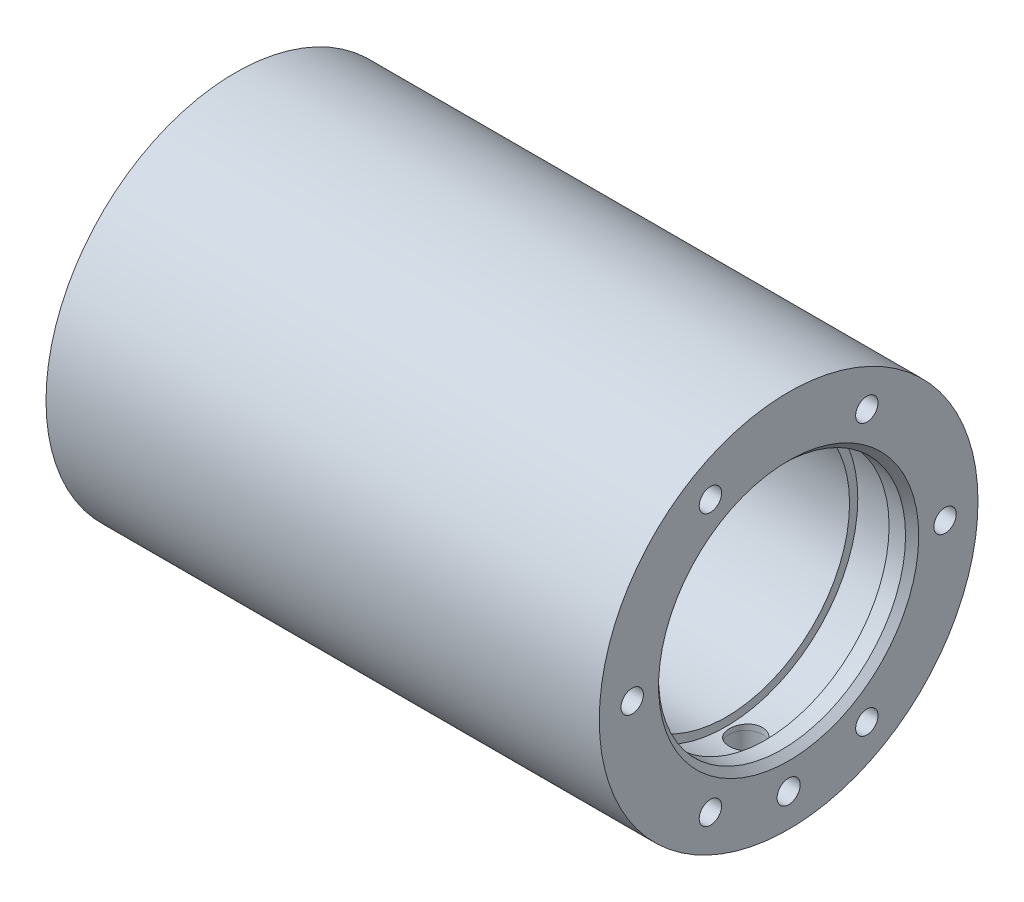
ISO-10303-21;
HEADER;
FILE_DESCRIPTION(('STEP AP214'),'2;1');
FILE_NAME('part.step','',(''),(''),'','','');
FILE_SCHEMA(('AUTOMOTIVE_DESIGN { 1 0 10303 214 1 1 1 1 }'));
ENDSEC;
DATA;
#1=APPLICATION_CONTEXT('core data for automotive mechanical design processes');
#2=APPLICATION_PROTOCOL_DEFINITION('international standard','automotive_design',2000,#1);
#3=PRODUCT_CONTEXT('',#1,'mechanical');
#4=PRODUCT('Part','Part','',(#3));
#5=PRODUCT_RELATED_PRODUCT_CATEGORY('part','',(#4));
#6=PRODUCT_DEFINITION_FORMATION('','',#4);
#7=PRODUCT_DEFINITION_CONTEXT('part definition',#1,'design');
#8=PRODUCT_DEFINITION('design','',#6,#7);
#9=PRODUCT_DEFINITION_SHAPE('','',#8);
#10=(LENGTH_UNIT() NAMED_UNIT(*) SI_UNIT(.MILLI.,.METRE.));
#11=(NAMED_UNIT(*) PLANE_ANGLE_UNIT() SI_UNIT($,.RADIAN.));
#12=(NAMED_UNIT(*) SI_UNIT($,.STERADIAN.) SOLID_ANGLE_UNIT());
#13=UNCERTAINTY_MEASURE_WITH_UNIT(LENGTH_MEASURE(1.E-05),#10,'distance_accuracy_value','');
#14=(GEOMETRIC_REPRESENTATION_CONTEXT(3) GLOBAL_UNCERTAINTY_ASSIGNED_CONTEXT((#13)) GLOBAL_UNIT_ASSIGNED_CONTEXT((#10,
#11,#12)) REPRESENTATION_CONTEXT('',''));
#15=CARTESIAN_POINT('',(0.,0.,0.));
#16=DIRECTION('',(0.,0.,1.));
#17=DIRECTION('',(1.,0.,0.));
#18=AXIS2_PLACEMENT_3D('',#15,#16,#17);
#19=CARTESIAN_POINT('',(0.,57.5,0.));
#20=DIRECTION('',(-1.,0.,0.));
#21=DIRECTION('',(0.,0.,1.));
#22=AXIS2_PLACEMENT_3D('',#19,#20,#21);
#23=PLANE('',#22);
#24=CARTESIAN_POINT('',(0.,-47.5,0.));
#25=DIRECTION('',(1.,0.,0.));
#26=DIRECTION('',(0.,0.,-1.));
#27=AXIS2_PLACEMENT_3D('',#24,#25,#26);
#28=CIRCLE('',#27,3.5);
#29=CARTESIAN_POINT('',(0.,-47.5,-3.5));
#30=VERTEX_POINT('',#29);
#31=EDGE_CURVE('E120',#30,#30,#28,.T.);
#32=ORIENTED_EDGE('',*,*,#31,.T.);
#33=EDGE_LOOP('',(#32));
#34=FACE_BOUND('',#33,.T.);
#35=CARTESIAN_POINT('',(0.,0.,0.));
#36=DIRECTION('',(-1.,0.,0.));
#37=DIRECTION('',(0.,0.,1.));
#38=AXIS2_PLACEMENT_3D('',#35,#36,#37);
#39=CIRCLE('',#38,39.5);
#40=CARTESIAN_POINT('',(0.,0.,39.5));
#41=VERTEX_POINT('',#40);
#42=EDGE_CURVE('E124',#41,#41,#39,.F.);
#43=ORIENTED_EDGE('',*,*,#42,.T.);
#44=EDGE_LOOP('',(#43));
#45=FACE_BOUND('',#44,.T.);
#46=CARTESIAN_POINT('',(0.,0.,0.));
#47=DIRECTION('',(1.,0.,0.));
#48=DIRECTION('',(0.,0.,-1.));
#49=AXIS2_PLACEMENT_3D('',#46,#47,#48);
#50=CIRCLE('',#49,57.5);
#51=CARTESIAN_POINT('',(0.,0.,-57.5));
#52=VERTEX_POINT('',#51);
#53=EDGE_CURVE('E128',#52,#52,#50,.T.);
#54=ORIENTED_EDGE('',*,*,#53,.F.);
#55=EDGE_LOOP('',(#54));
#56=FACE_BOUND('',#55,.T.);
#57=CARTESIAN_POINT('',(0.,0.,-47.5));
#58=DIRECTION('',(-1.,0.,0.));
#59=DIRECTION('',(0.,0.,1.));
#60=AXIS2_PLACEMENT_3D('',#57,#58,#59);
#61=CIRCLE('',#60,3.39999999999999);
#62=CARTESIAN_POINT('',(0.,0.,-44.1));
#63=VERTEX_POINT('',#62);
#64=EDGE_CURVE('E132',#63,#63,#61,.T.);
#65=ORIENTED_EDGE('',*,*,#64,.F.);
#66=EDGE_LOOP('',(#65));
#67=FACE_BOUND('',#66,.T.);
#68=CARTESIAN_POINT('',(0.,-41.1362066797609,-23.7499999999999));
#69=DIRECTION('',(-1.,0.,0.));
#70=DIRECTION('',(0.,0.,1.));
#71=AXIS2_PLACEMENT_3D('',#68,#69,#70);
#72=CIRCLE('',#71,3.39999999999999);
#73=CARTESIAN_POINT('',(0.,-41.1362066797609,-20.3499999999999));
#74=VERTEX_POINT('',#73);
#75=EDGE_CURVE('E136',#74,#74,#72,.T.);
#76=ORIENTED_EDGE('',*,*,#75,.F.);
#77=EDGE_LOOP('',(#76));
#78=FACE_BOUND('',#77,.T.);
#79=CARTESIAN_POINT('',(0.,-41.1362066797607,23.7500000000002));
#80=DIRECTION('',(-1.,0.,0.));
#81=DIRECTION('',(0.,0.,1.));
#82=AXIS2_PLACEMENT_3D('',#79,#80,#81);
#83=CIRCLE('',#82,3.39999999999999);
#84=CARTESIAN_POINT('',(0.,-41.1362066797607,27.1500000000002));
#85=VERTEX_POINT('',#84);
#86=EDGE_CURVE('E140',#85,#85,#83,.T.);
#87=ORIENTED_EDGE('',*,*,#86,.F.);
#88=EDGE_LOOP('',(#87));
#89=FACE_BOUND('',#88,.T.);
#90=CARTESIAN_POINT('',(0.,3.31690919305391E-13,47.5));
#91=DIRECTION('',(-1.,0.,0.));
#92=DIRECTION('',(0.,0.,1.));
#93=AXIS2_PLACEMENT_3D('',#90,#91,#92);
#94=CIRCLE('',#93,3.39999999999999);
#95=CARTESIAN_POINT('',(0.,3.31690919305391E-13,50.9));
#96=VERTEX_POINT('',#95);
#97=EDGE_CURVE('E144',#96,#96,#94,.T.);
#98=ORIENTED_EDGE('',*,*,#97,.F.);
#99=EDGE_LOOP('',(#98));
#100=FACE_BOUND('',#99,.T.);
#101=CARTESIAN_POINT('',(0.,41.1362066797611,23.7499999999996));
#102=DIRECTION('',(-1.,0.,0.));
#103=DIRECTION('',(0.,0.,1.));
#104=AXIS2_PLACEMENT_3D('',#101,#102,#103);
#105=CIRCLE('',#104,3.39999999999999);
#106=CARTESIAN_POINT('',(0.,41.1362066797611,27.1499999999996));
#107=VERTEX_POINT('',#106);
#108=EDGE_CURVE('E148',#107,#107,#105,.T.);
#109=ORIENTED_EDGE('',*,*,#108,.F.);
#110=EDGE_LOOP('',(#109));
#111=FACE_BOUND('',#110,.T.);
#112=CARTESIAN_POINT('',(0.,41.1362066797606,-23.7500000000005));
#113=DIRECTION('',(-1.,0.,0.));
#114=DIRECTION('',(0.,0.,1.));
#115=AXIS2_PLACEMENT_3D('',#112,#113,#114);
#116=CIRCLE('',#115,3.39999999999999);
#117=CARTESIAN_POINT('',(0.,41.1362066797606,-20.3500000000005));
#118=VERTEX_POINT('',#117);
#119=EDGE_CURVE('E152',#118,#118,#116,.T.);
#120=ORIENTED_EDGE('',*,*,#119,.F.);
#121=EDGE_LOOP('',(#120));
#122=FACE_BOUND('',#121,.T.);
#123=CARTESIAN_POINT('',(0.,24.2499999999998,42.0022320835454));
#124=DIRECTION('',(1.,0.,0.));
#125=DIRECTION('',(0.,0.,-1.));
#126=AXIS2_PLACEMENT_3D('',#123,#124,#125);
#127=CIRCLE('',#126,4.2);
#128=CARTESIAN_POINT('',(0.,24.2499999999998,37.8022320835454));
#129=VERTEX_POINT('',#128);
#130=EDGE_CURVE('E156',#129,#129,#127,.T.);
#131=ORIENTED_EDGE('',*,*,#130,.T.);
#132=EDGE_LOOP('',(#131));
#133=FACE_BOUND('',#132,.T.);
#134=CARTESIAN_POINT('',(0.,-24.2499999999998,-42.));
#135=DIRECTION('',(-1.,0.,0.));
#136=DIRECTION('',(0.,0.,1.));
#137=AXIS2_PLACEMENT_3D('',#134,#135,#136);
#138=CIRCLE('',#137,4.2);
#139=CARTESIAN_POINT('',(0.,-24.2499999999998,-37.8));
#140=VERTEX_POINT('',#139);
#141=EDGE_CURVE('E159',#140,#140,#138,.T.);
#142=ORIENTED_EDGE('',*,*,#141,.F.);
#143=EDGE_LOOP('',(#142));
#144=FACE_BOUND('',#143,.T.);
#145=ADVANCED_FACE('F43',(#34,#45,#56,#67,#78,#89,#100,#111,#122,#133,#144),#23,.T.);
#146=CARTESIAN_POINT('',(0.,0.,0.));
#147=DIRECTION('',(1.,0.,0.));
#148=DIRECTION('',(0.,0.,-1.));
#149=AXIS2_PLACEMENT_3D('',#146,#147,#148);
#150=CYLINDRICAL_SURFACE('',#149,57.5);
#151=CARTESIAN_POINT('',(168.,0.,0.));
#152=DIRECTION('',(1.,0.,0.));
#153=DIRECTION('',(0.,0.,-1.));
#154=AXIS2_PLACEMENT_3D('',#151,#152,#153);
#155=CIRCLE('',#154,57.5);
#156=CARTESIAN_POINT('',(168.,0.,-57.5));
#157=VERTEX_POINT('',#156);
#158=EDGE_CURVE('E697',#157,#157,#155,.T.);
#159=ORIENTED_EDGE('',*,*,#158,.F.);
#160=EDGE_LOOP('',(#159));
#161=FACE_BOUND('',#160,.T.);
#162=ORIENTED_EDGE('',*,*,#53,.T.);
#163=EDGE_LOOP('',(#162));
#164=FACE_BOUND('',#163,.T.);
#165=CARTESIAN_POINT('',(18.1833227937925,-57.3638719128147,-3.95426341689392));
#166=CARTESIAN_POINT('',(18.2946205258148,-57.3564888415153,-4.06136985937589));
#167=CARTESIAN_POINT('',(18.4104214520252,-57.3491288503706,-4.1637662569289));
#168=CARTESIAN_POINT('',(18.6502782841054,-57.334658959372,-4.35848776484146));
#169=CARTESIAN_POINT('',(18.7743361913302,-57.327549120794,-4.45081041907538));
#170=CARTESIAN_POINT('',(19.0299019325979,-57.3137781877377,-4.62476520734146));
#171=CARTESIAN_POINT('',(19.161415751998,-57.3071174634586,-4.70638857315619));
#172=CARTESIAN_POINT('',(19.4309242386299,-57.2944382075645,-4.85830890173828));
#173=CARTESIAN_POINT('',(19.5689212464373,-57.288419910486,-4.92860173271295));
#174=CARTESIAN_POINT('',(19.8502762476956,-57.277204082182,-5.05727825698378));
#175=CARTESIAN_POINT('',(19.9936304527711,-57.2720059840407,-5.11567018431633));
#176=CARTESIAN_POINT('',(20.2848277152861,-57.262572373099,-5.2202071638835));
#177=CARTESIAN_POINT('',(20.4326724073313,-57.2583372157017,-5.26634769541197));
#178=CARTESIAN_POINT('',(20.7316553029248,-57.2509556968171,-5.34599590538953));
#179=CARTESIAN_POINT('',(20.8827914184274,-57.2478086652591,-5.37951135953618));
#180=CARTESIAN_POINT('',(21.1874238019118,-57.2426891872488,-5.43371671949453));
#181=CARTESIAN_POINT('',(21.3409209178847,-57.2407171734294,-5.4544019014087));
#182=CARTESIAN_POINT('',(21.6487311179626,-57.2380097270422,-5.4827406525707));
#183=CARTESIAN_POINT('',(21.8030411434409,-57.2372711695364,-5.4904271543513));
#184=CARTESIAN_POINT('',(22.111819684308,-57.2370420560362,-5.49281515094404));
#185=CARTESIAN_POINT('',(22.2662882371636,-57.2375519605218,-5.48751185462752));
#186=CARTESIAN_POINT('',(22.5741724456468,-57.2398057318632,-5.46395270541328));
#187=CARTESIAN_POINT('',(22.7275884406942,-57.2415491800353,-5.44570124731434));
#188=CARTESIAN_POINT('',(23.0323843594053,-57.2462205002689,-5.39637390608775));
#189=CARTESIAN_POINT('',(23.183763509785,-57.2491488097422,-5.36529328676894));
#190=CARTESIAN_POINT('',(23.4830924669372,-57.2561000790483,-5.2905960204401));
#191=CARTESIAN_POINT('',(23.6310477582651,-57.2601211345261,-5.24700117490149));
#192=CARTESIAN_POINT('',(23.9228055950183,-57.2691471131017,-5.14755098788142));
#193=CARTESIAN_POINT('',(24.0666065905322,-57.2741523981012,-5.09169113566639));
#194=CARTESIAN_POINT('',(24.3489459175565,-57.2850026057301,-4.96813018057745));
#195=CARTESIAN_POINT('',(24.4874860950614,-57.2908472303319,-4.90043327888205));
#196=CARTESIAN_POINT('',(24.7583963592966,-57.3032111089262,-4.75367431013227));
#197=CARTESIAN_POINT('',(24.8907641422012,-57.3097306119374,-4.67460804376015));
#198=CARTESIAN_POINT('',(25.2777602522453,-57.3300607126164,-4.42074781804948));
#199=CARTESIAN_POINT('',(25.5218327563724,-57.3446247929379,-4.22948912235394));
#200=CARTESIAN_POINT('',(25.9742899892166,-57.3740971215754,-3.80884667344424));
#201=CARTESIAN_POINT('',(26.1826742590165,-57.3890053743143,-3.57946243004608));
#202=CARTESIAN_POINT('',(26.5583787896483,-57.4175231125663,-3.08844702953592));
#203=CARTESIAN_POINT('',(26.7256259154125,-57.4311302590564,-2.82675966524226));
#204=CARTESIAN_POINT('',(27.0137100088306,-57.4554773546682,-2.27886380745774));
#205=CARTESIAN_POINT('',(27.1345479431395,-57.466217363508,-1.99265582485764));
#206=CARTESIAN_POINT('',(27.325976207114,-57.483585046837,-1.4048325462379));
#207=CARTESIAN_POINT('',(27.3967323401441,-57.4902262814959,-1.10327166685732));
#208=CARTESIAN_POINT('',(27.4865551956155,-57.4987017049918,-0.49248537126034));
#209=CARTESIAN_POINT('',(27.5056236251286,-57.5005360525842,-0.183260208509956));
#210=CARTESIAN_POINT('',(27.4915439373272,-57.4991938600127,0.432503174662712));
#211=CARTESIAN_POINT('',(27.458644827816,-57.4960412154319,0.739047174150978));
#212=CARTESIAN_POINT('',(27.3420646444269,-57.4851236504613,1.34223274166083));
#213=CARTESIAN_POINT('',(27.2583835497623,-57.4773587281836,1.63887430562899));
#214=CARTESIAN_POINT('',(27.0426542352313,-57.4580829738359,2.21394814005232));
#215=CARTESIAN_POINT('',(26.9105958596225,-57.4465713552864,2.49237657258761));
#216=CARTESIAN_POINT('',(26.6018992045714,-57.421085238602,3.02318946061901));
#217=CARTESIAN_POINT('',(26.4252595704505,-57.40711066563,3.2755731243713));
#218=CARTESIAN_POINT('',(26.0314173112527,-57.3781799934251,3.74846066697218));
#219=CARTESIAN_POINT('',(25.8140202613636,-57.3632194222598,3.96880235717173));
#220=CARTESIAN_POINT('',(25.3453573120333,-57.3340548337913,4.36997922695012));
#221=CARTESIAN_POINT('',(25.0940907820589,-57.3198508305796,4.5508136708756));
#222=CARTESIAN_POINT('',(24.5639238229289,-57.2937549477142,4.86838859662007));
#223=CARTESIAN_POINT('',(24.284941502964,-57.2818702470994,5.00499300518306));
#224=CARTESIAN_POINT('',(23.7078844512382,-57.261816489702,5.22945025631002));
#225=CARTESIAN_POINT('',(23.4098100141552,-57.2536473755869,5.31730385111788));
#226=CARTESIAN_POINT('',(22.8036540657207,-57.2419679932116,5.44160228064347));
#227=CARTESIAN_POINT('',(22.4955935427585,-57.2384485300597,5.47814858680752));
#228=CARTESIAN_POINT('',(21.8776904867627,-57.2364399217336,5.49909670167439));
#229=CARTESIAN_POINT('',(21.5678479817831,-57.2379506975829,5.48349932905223));
#230=CARTESIAN_POINT('',(20.9559860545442,-57.2458198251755,5.40072260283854));
#231=CARTESIAN_POINT('',(20.6539491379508,-57.2521661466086,5.33367125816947));
#232=CARTESIAN_POINT('',(20.0654309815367,-57.2689736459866,5.15005616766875));
#233=CARTESIAN_POINT('',(19.7789499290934,-57.2794348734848,5.03349182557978));
#234=CARTESIAN_POINT('',(19.2291969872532,-57.3033094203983,4.75398537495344));
#235=CARTESIAN_POINT('',(18.9659626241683,-57.316727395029,4.59097001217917));
#236=CARTESIAN_POINT('',(18.4704633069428,-57.3450053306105,4.22305565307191));
#237=CARTESIAN_POINT('',(18.2381990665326,-57.35986532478,4.01815569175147));
#238=CARTESIAN_POINT('',(17.9178848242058,-57.3819898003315,3.68372483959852));
#239=CARTESIAN_POINT('',(17.8156248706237,-57.3893509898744,3.56748543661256));
#240=CARTESIAN_POINT('',(17.6212748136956,-57.4038058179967,3.32679843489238));
#241=CARTESIAN_POINT('',(17.5291809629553,-57.4108995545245,3.20235388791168));
#242=CARTESIAN_POINT('',(17.3557911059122,-57.4246210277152,2.94607783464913));
#243=CARTESIAN_POINT('',(17.2744990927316,-57.4312485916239,2.81424362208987));
#244=CARTESIAN_POINT('',(17.1233561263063,-57.443844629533,2.54420367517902));
#245=CARTESIAN_POINT('',(17.0535008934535,-57.4498133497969,2.40600034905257));
#246=CARTESIAN_POINT('',(16.9257862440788,-57.4609174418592,2.12433616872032));
#247=CARTESIAN_POINT('',(16.8679118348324,-57.4660538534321,1.98088215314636));
#248=CARTESIAN_POINT('',(16.7644902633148,-57.4753545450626,1.68962671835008));
#249=CARTESIAN_POINT('',(16.7189384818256,-57.4795191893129,1.54182695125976));
#250=CARTESIAN_POINT('',(16.6404572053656,-57.4867612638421,1.24283798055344));
#251=CARTESIAN_POINT('',(16.6075316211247,-57.4898383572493,1.0916477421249));
#252=CARTESIAN_POINT('',(16.5545769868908,-57.4948147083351,0.787064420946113));
#253=CARTESIAN_POINT('',(16.53454309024,-57.4967144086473,0.633672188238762));
#254=CARTESIAN_POINT('',(16.5075667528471,-57.4992773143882,0.326477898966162));
#255=CARTESIAN_POINT('',(16.5005615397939,-57.4999464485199,0.172681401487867));
#256=CARTESIAN_POINT('',(16.4995035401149,-57.5000473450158,-0.13489926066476));
#257=CARTESIAN_POINT('',(16.5054459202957,-57.4994795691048,-0.288683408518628));
#258=CARTESIAN_POINT('',(16.5302365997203,-57.4971229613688,-0.595288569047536));
#259=CARTESIAN_POINT('',(16.5490924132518,-57.4953334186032,-0.748108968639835));
#260=CARTESIAN_POINT('',(16.5995691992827,-57.4905840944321,-1.05155035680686));
#261=CARTESIAN_POINT('',(16.6311854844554,-57.4876247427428,-1.2021721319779));
#262=CARTESIAN_POINT('',(16.7069111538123,-57.4806230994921,-1.50004697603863));
#263=CARTESIAN_POINT('',(16.7510073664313,-57.476581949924,-1.64730342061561));
#264=CARTESIAN_POINT('',(16.8513663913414,-57.4675307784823,-1.93751862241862));
#265=CARTESIAN_POINT('',(16.9076248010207,-57.4625211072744,-2.08047891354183));
#266=CARTESIAN_POINT('',(17.0318653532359,-57.4516766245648,-2.36104782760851));
#267=CARTESIAN_POINT('',(17.0998383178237,-57.4458424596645,-2.49866053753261));
#268=CARTESIAN_POINT('',(17.2470249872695,-57.4335115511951,-2.76764956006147));
#269=CARTESIAN_POINT('',(17.3262360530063,-57.4270149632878,-2.89902732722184));
#270=CARTESIAN_POINT('',(17.5220263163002,-57.4114134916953,-3.1949832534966));
#271=CARTESIAN_POINT('',(17.6425168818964,-57.4021316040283,-3.35698406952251));
#272=CARTESIAN_POINT('',(17.9005571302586,-57.3831773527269,-3.66675053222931));
#273=CARTESIAN_POINT('',(18.0381068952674,-57.3735049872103,-3.81451611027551));
#274=CARTESIAN_POINT('',(18.1833227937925,-57.3638719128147,-3.95426341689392));
#275=B_SPLINE_CURVE_WITH_KNOTS('',3,(#165,#166,#167,#168,#169,#170,#171,#172,#173,#174,#175,
#176,#177,#178,#179,#180,#181,#182,#183,#184,#185,#186,#187,#188,#189,#190,#191,#192,#193,#194,
#195,#196,#197,#198,#199,#200,#201,#202,#203,#204,#205,#206,#207,#208,#209,#210,#211,#212,#213,
#214,#215,#216,#217,#218,#219,#220,#221,#222,#223,#224,#225,#226,#227,#228,#229,#230,#231,#232,
#233,#234,#235,#236,#237,#238,#239,#240,#241,#242,#243,#244,#245,#246,#247,#248,#249,#250,#251,
#252,#253,#254,#255,#256,#257,#258,#259,#260,#261,#262,#263,#264,#265,#266,#267,#268,#269,#270,
#271,#272,#273,#274),.UNSPECIFIED.,.T.,.F.,(4,2,2,2,2,2,2,2,2,2,2,2,2,2,2,2,2,2,2,2,2,2,2,2,2,2,
2,2,2,2,2,2,2,2,2,2,2,2,2,2,2,2,2,2,2,2,2,2,2,2,2,2,2,2,4),(0.,0.463744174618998,
0.927601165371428,1.39183594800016,1.85623963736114,2.32032091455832,2.78457319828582,
3.24853908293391,3.71267569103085,4.17563462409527,4.63876433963,5.10173693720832,
5.56488060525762,6.02722226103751,6.48973423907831,6.9520823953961,7.41460176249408,
8.34109250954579,9.26759516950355,10.1957332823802,11.1238520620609,12.0488836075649,
12.9738846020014,13.8944667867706,14.8150493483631,15.7358252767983,16.6566291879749,
17.5819428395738,18.5072737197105,19.4354249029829,20.3635617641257,21.2898604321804,
22.2161445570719,23.1401316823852,24.064129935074,24.9895934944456,25.9150783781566,
26.3796051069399,26.8439600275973,27.3084861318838,27.7728380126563,28.2366052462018,
28.7001983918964,29.1639350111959,29.6274971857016,30.0888200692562,30.5499707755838,
31.0113900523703,31.4726399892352,31.9334049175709,32.3940033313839,32.8542425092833,
33.3143737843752,33.9194418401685,34.5245128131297),.UNSPECIFIED.);
#276=CARTESIAN_POINT('',(18.1833227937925,-57.3638719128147,-3.95426341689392));
#277=VERTEX_POINT('',#276);
#278=EDGE_CURVE('E628',#277,#277,#275,.T.);
#279=ORIENTED_EDGE('',*,*,#278,.F.);
#280=EDGE_LOOP('',(#279));
#281=FACE_BOUND('',#280,.T.);
#282=CARTESIAN_POINT('',(151.183322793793,-57.3638719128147,-3.95426341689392));
#283=CARTESIAN_POINT('',(151.072211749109,-57.3712424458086,-3.84734054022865));
#284=CARTESIAN_POINT('',(150.965621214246,-57.3786338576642,-3.7357548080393));
#285=CARTESIAN_POINT('',(150.762162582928,-57.3932544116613,-3.5039733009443));
#286=CARTESIAN_POINT('',(150.665296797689,-57.4004835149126,-3.38377549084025));
#287=CARTESIAN_POINT('',(150.481943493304,-57.4145785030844,-3.13554457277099));
#288=CARTESIAN_POINT('',(150.395464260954,-57.4214440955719,-3.00750532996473));
#289=CARTESIAN_POINT('',(150.233559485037,-57.4346142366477,-2.74452599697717));
#290=CARTESIAN_POINT('',(150.158137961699,-57.4409185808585,-2.60958342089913));
#291=CARTESIAN_POINT('',(150.018972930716,-57.4527810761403,-2.33387479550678));
#292=CARTESIAN_POINT('',(149.955222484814,-57.4583396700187,-2.19311226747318));
#293=CARTESIAN_POINT('',(149.839786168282,-57.4685592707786,-1.90663160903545));
#294=CARTESIAN_POINT('',(149.788104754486,-57.4732199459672,-1.76091167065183));
#295=CARTESIAN_POINT('',(149.697243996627,-57.4815059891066,-1.4656941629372));
#296=CARTESIAN_POINT('',(149.658056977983,-57.4851319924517,-1.31619897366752));
#297=CARTESIAN_POINT('',(149.592418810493,-57.4912503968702,-1.01435732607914));
#298=CARTESIAN_POINT('',(149.56597234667,-57.4937423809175,-0.862009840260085));
#299=CARTESIAN_POINT('',(149.526115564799,-57.4975118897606,-0.556243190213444));
#300=CARTESIAN_POINT('',(149.512651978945,-57.4987943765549,-0.402831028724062));
#301=CARTESIAN_POINT('',(149.498668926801,-57.5001265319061,-0.0953555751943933));
#302=CARTESIAN_POINT('',(149.498154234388,-57.5001757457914,0.0587079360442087));
#303=CARTESIAN_POINT('',(149.510082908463,-57.4990389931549,0.366273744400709));
#304=CARTESIAN_POINT('',(149.522521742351,-57.497853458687,0.519776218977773));
#305=CARTESIAN_POINT('',(149.560265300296,-57.4942808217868,0.825234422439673));
#306=CARTESIAN_POINT('',(149.585574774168,-57.4918932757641,0.977189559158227));
#307=CARTESIAN_POINT('',(149.648782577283,-57.4859927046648,1.27796801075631));
#308=CARTESIAN_POINT('',(149.686643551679,-57.4824830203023,1.42679924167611));
#309=CARTESIAN_POINT('',(149.774710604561,-57.4744335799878,1.72079122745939));
#310=CARTESIAN_POINT('',(149.824921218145,-57.4698934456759,1.86595061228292));
#311=CARTESIAN_POINT('',(149.937306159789,-57.4599122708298,2.15148115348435));
#312=CARTESIAN_POINT('',(149.999476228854,-57.4544715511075,2.29185399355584));
#313=CARTESIAN_POINT('',(150.135334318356,-57.4428415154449,2.56689585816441));
#314=CARTESIAN_POINT('',(150.209026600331,-57.436651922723,2.70156274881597));
#315=CARTESIAN_POINT('',(150.447136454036,-57.4171743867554,3.09635149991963));
#316=CARTESIAN_POINT('',(150.628322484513,-57.4030023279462,3.34659078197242));
#317=CARTESIAN_POINT('',(151.029871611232,-57.373907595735,3.81308438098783));
#318=CARTESIAN_POINT('',(151.250235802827,-57.358984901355,4.02933774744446));
#319=CARTESIAN_POINT('',(151.72518467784,-57.3299790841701,4.42297207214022));
#320=CARTESIAN_POINT('',(151.979925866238,-57.315900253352,4.6001648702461));
#321=CARTESIAN_POINT('',(152.515620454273,-57.2902498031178,4.90932351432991));
#322=CARTESIAN_POINT('',(152.796573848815,-57.2786781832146,5.04128936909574));
#323=CARTESIAN_POINT('',(153.376800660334,-57.2593524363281,5.25626091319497));
#324=CARTESIAN_POINT('',(153.676076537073,-57.2515988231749,5.33926001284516));
#325=CARTESIAN_POINT('',(154.284391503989,-57.2407957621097,5.45386660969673));
#326=CARTESIAN_POINT('',(154.59343037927,-57.2377462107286,5.48547523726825));
#327=CARTESIAN_POINT('',(155.211480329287,-57.2367011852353,5.49636856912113));
#328=CARTESIAN_POINT('',(155.520488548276,-57.2386901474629,5.47581440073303));
#329=CARTESIAN_POINT('',(156.130643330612,-57.2474629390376,5.38331777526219));
#330=CARTESIAN_POINT('',(156.431789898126,-57.2542467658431,5.31137534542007));
#331=CARTESIAN_POINT('',(157.017580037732,-57.2718365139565,5.11820991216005));
#332=CARTESIAN_POINT('',(157.302229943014,-57.2826408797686,4.99700596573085));
#333=CARTESIAN_POINT('',(157.84715881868,-57.3070537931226,4.7087590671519));
#334=CARTESIAN_POINT('',(158.107437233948,-57.3206624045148,4.54171507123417));
#335=CARTESIAN_POINT('',(158.597073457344,-57.3491999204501,4.16590653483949));
#336=CARTESIAN_POINT('',(158.826335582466,-57.3641326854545,3.95701761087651));
#337=CARTESIAN_POINT('',(159.246541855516,-57.3936027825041,3.50368948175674));
#338=CARTESIAN_POINT('',(159.437485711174,-57.4081401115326,3.25925000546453));
#339=CARTESIAN_POINT('',(159.775748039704,-57.435193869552,2.74146995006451));
#340=CARTESIAN_POINT('',(159.923032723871,-57.4477087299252,2.46810720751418));
#341=CARTESIAN_POINT('',(160.16950676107,-57.4692891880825,1.90036959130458));
#342=CARTESIAN_POINT('',(160.26869748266,-57.4783548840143,1.60599531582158));
#343=CARTESIAN_POINT('',(160.41575614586,-57.4919801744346,1.0059117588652));
#344=CARTESIAN_POINT('',(160.463838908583,-57.4965586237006,0.700255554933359));
#345=CARTESIAN_POINT('',(160.508000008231,-57.5007591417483,0.0851785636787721));
#346=CARTESIAN_POINT('',(160.504079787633,-57.5003813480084,-0.224242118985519));
#347=CARTESIAN_POINT('',(160.444481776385,-57.4947244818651,-0.836718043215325));
#348=CARTESIAN_POINT('',(160.389016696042,-57.489465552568,-1.13979421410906));
#349=CARTESIAN_POINT('',(160.228246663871,-57.4746633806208,-1.73232323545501));
#350=CARTESIAN_POINT('',(160.122941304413,-57.4651201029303,-2.02177597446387));
#351=CARTESIAN_POINT('',(159.865371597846,-57.44279821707,-2.57934431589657));
#352=CARTESIAN_POINT('',(159.713032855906,-57.4300144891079,-2.84742526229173));
#353=CARTESIAN_POINT('',(159.365631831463,-57.4026340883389,-3.35441484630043));
#354=CARTESIAN_POINT('',(159.170568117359,-57.3880373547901,-3.59332250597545));
#355=CARTESIAN_POINT('',(158.849828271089,-57.3659806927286,-3.92514000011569));
#356=CARTESIAN_POINT('',(158.737838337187,-57.3585786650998,-4.03160624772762));
#357=CARTESIAN_POINT('',(158.505305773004,-57.3439390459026,-4.23473700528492));
#358=CARTESIAN_POINT('',(158.384766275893,-57.3367013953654,-4.3314050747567));
#359=CARTESIAN_POINT('',(158.135928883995,-57.3225921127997,-4.51429514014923));
#360=CARTESIAN_POINT('',(158.007628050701,-57.3157206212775,-4.60051314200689));
#361=CARTESIAN_POINT('',(157.744253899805,-57.3025433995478,-4.76183447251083));
#362=CARTESIAN_POINT('',(157.609183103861,-57.2962374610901,-4.83694189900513));
#363=CARTESIAN_POINT('',(157.332859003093,-57.2843540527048,-4.97570547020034));
#364=CARTESIAN_POINT('',(157.191592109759,-57.2787783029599,-5.03933470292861));
#365=CARTESIAN_POINT('',(156.904223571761,-57.268533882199,-5.15445120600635));
#366=CARTESIAN_POINT('',(156.758123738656,-57.2638648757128,-5.20594296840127));
#367=CARTESIAN_POINT('',(156.462031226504,-57.2555638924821,-5.29645841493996));
#368=CARTESIAN_POINT('',(156.312037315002,-57.2519322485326,-5.33547809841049));
#369=CARTESIAN_POINT('',(156.009329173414,-57.2458135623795,-5.40073185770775));
#370=CARTESIAN_POINT('',(155.856615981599,-57.243326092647,-5.42697070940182));
#371=CARTESIAN_POINT('',(155.549873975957,-57.2395698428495,-5.46644648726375));
#372=CARTESIAN_POINT('',(155.39584916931,-57.2382981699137,-5.47971427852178));
#373=CARTESIAN_POINT('',(155.087281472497,-57.2369999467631,-5.49325802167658));
#374=CARTESIAN_POINT('',(154.932738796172,-57.2369729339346,-5.4935388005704));
#375=CARTESIAN_POINT('',(154.624090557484,-57.2381639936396,-5.48111497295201));
#376=CARTESIAN_POINT('',(154.469985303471,-57.2393827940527,-5.46840277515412));
#377=CARTESIAN_POINT('',(154.163459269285,-57.2430309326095,-5.43008094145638));
#378=CARTESIAN_POINT('',(154.011037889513,-57.2454598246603,-5.40447605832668));
#379=CARTESIAN_POINT('',(153.709053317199,-57.2514554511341,-5.34058756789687));
#380=CARTESIAN_POINT('',(153.559487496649,-57.2550210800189,-5.30231627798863));
#381=CARTESIAN_POINT('',(153.264176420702,-57.2631875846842,-5.21338076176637));
#382=CARTESIAN_POINT('',(153.118429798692,-57.2677880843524,-5.16272103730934));
#383=CARTESIAN_POINT('',(152.831837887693,-57.2778904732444,-5.04940527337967));
#384=CARTESIAN_POINT('',(152.690988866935,-57.2833916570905,-4.98675861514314));
#385=CARTESIAN_POINT('',(152.415107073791,-57.2951398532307,-4.84991343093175));
#386=CARTESIAN_POINT('',(152.280072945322,-57.3013866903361,-4.77571761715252));
#387=CARTESIAN_POINT('',(151.974486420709,-57.3165475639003,-4.59070152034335));
#388=CARTESIAN_POINT('',(151.806417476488,-57.3256748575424,-4.47576371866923));
#389=CARTESIAN_POINT('',(151.484055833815,-57.3444799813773,-4.22800496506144));
#390=CARTESIAN_POINT('',(151.32976318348,-57.3541578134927,-4.09518395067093));
#391=CARTESIAN_POINT('',(151.183322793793,-57.3638719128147,-3.95426341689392));
#392=B_SPLINE_CURVE_WITH_KNOTS('',3,(#282,#283,#284,#285,#286,#287,#288,#289,#290,#291,#292,
#293,#294,#295,#296,#297,#298,#299,#300,#301,#302,#303,#304,#305,#306,#307,#308,#309,#310,#311,
#312,#313,#314,#315,#316,#317,#318,#319,#320,#321,#322,#323,#324,#325,#326,#327,#328,#329,#330,
#331,#332,#333,#334,#335,#336,#337,#338,#339,#340,#341,#342,#343,#344,#345,#346,#347,#348,#349,
#350,#351,#352,#353,#354,#355,#356,#357,#358,#359,#360,#361,#362,#363,#364,#365,#366,#367,#368,
#369,#370,#371,#372,#373,#374,#375,#376,#377,#378,#379,#380,#381,#382,#383,#384,#385,#386,#387,
#388,#389,#390,#391),.UNSPECIFIED.,.T.,.F.,(4,2,2,2,2,2,2,2,2,2,2,2,2,2,2,2,2,2,2,2,2,2,2,2,2,2,
2,2,2,2,2,2,2,2,2,2,2,2,2,2,2,2,2,2,2,2,2,2,2,2,2,2,2,2,4),(0.,0.462957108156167,
0.926023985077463,1.38945789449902,1.85305987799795,2.31638535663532,2.77988166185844,
3.24309271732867,3.70647397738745,4.16794582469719,4.62958780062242,5.09106829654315,
5.55271922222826,6.01300836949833,6.47346679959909,6.93376155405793,7.39422695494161,
8.31729482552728,9.24038850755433,10.1678361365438,11.0952835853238,12.0228558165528,
12.9504076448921,13.8750978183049,14.7997875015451,15.7241198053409,16.6484731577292,
17.575616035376,18.5027659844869,19.4306316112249,20.3584708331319,21.2823944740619,
22.2062924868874,23.126394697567,24.0465044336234,24.9680770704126,25.8896805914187,
26.3533261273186,26.8168026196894,27.2804556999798,27.7439373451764,28.2084919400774,
28.6728743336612,29.1374055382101,29.6017630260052,30.0650128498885,30.5280904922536,
30.9914388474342,31.4546165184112,31.9173450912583,32.3799057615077,32.8421058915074,
33.3041976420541,33.914356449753,34.5245173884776),.UNSPECIFIED.);
#393=CARTESIAN_POINT('',(151.183322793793,-57.3638719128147,-3.95426341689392));
#394=VERTEX_POINT('',#393);
#395=EDGE_CURVE('E13',#394,#394,#392,.T.);
#396=ORIENTED_EDGE('',*,*,#395,.T.);
#397=EDGE_LOOP('',(#396));
#398=FACE_BOUND('',#397,.T.);
#399=ADVANCED_FACE('F109',(#161,#164,#281,#398),#150,.T.);
#400=CARTESIAN_POINT('',(0.,0.,0.));
#401=DIRECTION('',(1.,0.,0.));
#402=DIRECTION('',(0.,0.,-1.));
#403=AXIS2_PLACEMENT_3D('',#400,#401,#402);
#404=CYLINDRICAL_SURFACE('',#403,40.);
#405=CARTESIAN_POINT('',(149.,0.,0.));
#406=DIRECTION('',(1.,0.,0.));
#407=DIRECTION('',(0.,0.,-1.));
#408=AXIS2_PLACEMENT_3D('',#405,#406,#407);
#409=CIRCLE('',#408,40.);
#410=CARTESIAN_POINT('',(149.,0.,-40.));
#411=VERTEX_POINT('',#410);
#412=EDGE_CURVE('E689',#411,#411,#409,.T.);
#413=ORIENTED_EDGE('',*,*,#412,.F.);
#414=EDGE_LOOP('',(#413));
#415=FACE_BOUND('',#414,.T.);
#416=CARTESIAN_POINT('',(161.,0.,0.));
#417=DIRECTION('',(1.,0.,0.));
#418=DIRECTION('',(0.,0.,-1.));
#419=AXIS2_PLACEMENT_3D('',#416,#417,#418);
#420=CIRCLE('',#419,40.);
#421=CARTESIAN_POINT('',(161.,0.,-40.));
#422=VERTEX_POINT('',#421);
#423=EDGE_CURVE('E692',#422,#422,#420,.T.);
#424=ORIENTED_EDGE('',*,*,#423,.T.);
#425=EDGE_LOOP('',(#424));
#426=FACE_BOUND('',#425,.T.);
#427=CARTESIAN_POINT('',(155.,-39.6862696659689,5.));
#428=CARTESIAN_POINT('',(154.860114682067,-39.6862691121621,5.00000160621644));
#429=CARTESIAN_POINT('',(154.720252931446,-39.6870107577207,4.99412753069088));
#430=CARTESIAN_POINT('',(154.441485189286,-39.6899549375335,4.97067638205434));
#431=CARTESIAN_POINT('',(154.302579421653,-39.6921578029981,4.95309665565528));
#432=CARTESIAN_POINT('',(154.026659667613,-39.6979640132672,4.90634338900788));
#433=CARTESIAN_POINT('',(153.889647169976,-39.7015684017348,4.87716120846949));
#434=CARTESIAN_POINT('',(153.618539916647,-39.7100751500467,4.80740736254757));
#435=CARTESIAN_POINT('',(153.484446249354,-39.7149779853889,4.76683152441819));
#436=CARTESIAN_POINT('',(153.220316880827,-39.725934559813,4.67464155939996));
#437=CARTESIAN_POINT('',(153.090277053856,-39.7319870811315,4.62303910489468));
#438=CARTESIAN_POINT('',(152.83497080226,-39.7450763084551,4.50912356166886));
#439=CARTESIAN_POINT('',(152.709706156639,-39.7521133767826,4.44680652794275));
#440=CARTESIAN_POINT('',(152.464939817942,-39.7669663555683,4.31195814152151));
#441=CARTESIAN_POINT('',(152.345435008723,-39.7747818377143,4.23943239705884));
#442=CARTESIAN_POINT('',(152.112897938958,-39.7909775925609,4.08462468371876));
#443=CARTESIAN_POINT('',(151.999868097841,-39.7993580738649,4.00233910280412));
#444=CARTESIAN_POINT('',(151.780601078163,-39.8164855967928,3.82820600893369));
#445=CARTESIAN_POINT('',(151.674397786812,-39.8252341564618,3.73631597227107));
#446=CARTESIAN_POINT('',(151.470059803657,-39.8428175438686,3.54389956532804));
#447=CARTESIAN_POINT('',(151.371928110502,-39.8516524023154,3.44337001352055));
#448=CARTESIAN_POINT('',(151.184491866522,-39.8691534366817,3.23443774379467));
#449=CARTESIAN_POINT('',(151.095184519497,-39.877819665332,3.12603753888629));
#450=CARTESIAN_POINT('',(150.925957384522,-39.8947456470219,2.90204868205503));
#451=CARTESIAN_POINT('',(150.846041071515,-39.9030052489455,2.7864573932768));
#452=CARTESIAN_POINT('',(150.695979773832,-39.9189053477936,2.54857670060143));
#453=CARTESIAN_POINT('',(150.625864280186,-39.9265439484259,2.42626856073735));
#454=CARTESIAN_POINT('',(150.496166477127,-39.9409609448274,2.1760854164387));
#455=CARTESIAN_POINT('',(150.436588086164,-39.9477390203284,2.0482083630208));
#456=CARTESIAN_POINT('',(150.328452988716,-39.9602359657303,1.78787475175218));
#457=CARTESIAN_POINT('',(150.279891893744,-39.965955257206,1.65542004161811));
#458=CARTESIAN_POINT('',(150.194105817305,-39.9761783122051,1.38682919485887));
#459=CARTESIAN_POINT('',(150.1568849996,-39.9806816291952,1.25069172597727));
#460=CARTESIAN_POINT('',(150.063069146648,-39.9921145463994,0.839750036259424));
#461=CARTESIAN_POINT('',(150.023630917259,-39.99704953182,0.560750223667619));
#462=CARTESIAN_POINT('',(149.992114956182,-40.0009837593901,0.000203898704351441));
#463=CARTESIAN_POINT('',(150.000035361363,-39.9999832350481,-0.281342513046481));
#464=CARTESIAN_POINT('',(150.062754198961,-39.9921923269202,-0.837519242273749));
#465=CARTESIAN_POINT('',(150.117290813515,-39.9854342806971,-1.11217938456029));
#466=CARTESIAN_POINT('',(150.271301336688,-39.9669212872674,-1.64840735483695));
#467=CARTESIAN_POINT('',(150.3707760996,-39.9551662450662,-1.9099749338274));
#468=CARTESIAN_POINT('',(150.612113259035,-39.9279251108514,-2.41341681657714));
#469=CARTESIAN_POINT('',(150.754088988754,-39.9124290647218,-2.65523623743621));
#470=CARTESIAN_POINT('',(151.076316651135,-39.8794393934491,-3.11171512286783));
#471=CARTESIAN_POINT('',(151.256570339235,-39.8619456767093,-3.32637334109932));
#472=CARTESIAN_POINT('',(151.651703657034,-39.8267773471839,-3.72397600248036));
#473=CARTESIAN_POINT('',(151.866811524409,-39.8091023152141,-3.90669366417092));
#474=CARTESIAN_POINT('',(152.324763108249,-39.775681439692,-4.23346571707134));
#475=CARTESIAN_POINT('',(152.567606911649,-39.7599356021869,-4.3775199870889));
#476=CARTESIAN_POINT('',(153.074338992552,-39.7321560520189,-4.62288914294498));
#477=CARTESIAN_POINT('',(153.338236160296,-39.7201239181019,-4.72418585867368));
#478=CARTESIAN_POINT('',(153.879478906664,-39.7011648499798,-4.8809633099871));
#479=CARTESIAN_POINT('',(154.156823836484,-39.6942376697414,-4.93644625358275));
#480=CARTESIAN_POINT('',(154.715086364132,-39.6863177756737,-4.99972086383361));
#481=CARTESIAN_POINT('',(154.99596724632,-39.6852853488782,-5.00783168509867));
#482=CARTESIAN_POINT('',(155.555083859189,-39.6891668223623,-4.97697390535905));
#483=CARTESIAN_POINT('',(155.833319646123,-39.694080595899,-4.93800630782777));
#484=CARTESIAN_POINT('',(156.37829152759,-39.7092645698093,-4.8143665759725));
#485=CARTESIAN_POINT('',(156.645063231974,-39.7195166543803,-4.72984898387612));
#486=CARTESIAN_POINT('',(157.160648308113,-39.7442073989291,-4.51766742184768));
#487=CARTESIAN_POINT('',(157.409461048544,-39.7586462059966,-4.39000193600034));
#488=CARTESIAN_POINT('',(157.883509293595,-39.790178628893,-4.09436410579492));
#489=CARTESIAN_POINT('',(158.108613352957,-39.807285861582,-3.92618246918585));
#490=CARTESIAN_POINT('',(158.527513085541,-39.8421847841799,-3.5545812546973));
#491=CARTESIAN_POINT('',(158.721307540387,-39.8599765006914,-3.35116030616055));
#492=CARTESIAN_POINT('',(159.073208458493,-39.8943617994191,-2.9134644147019));
#493=CARTESIAN_POINT('',(159.231105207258,-39.9109479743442,-2.67902021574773));
#494=CARTESIAN_POINT('',(159.505276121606,-39.9409421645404,-2.18674193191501));
#495=CARTESIAN_POINT('',(159.621551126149,-39.9543502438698,-1.92890831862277));
#496=CARTESIAN_POINT('',(159.808836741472,-39.9764461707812,-1.39791974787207));
#497=CARTESIAN_POINT('',(159.879968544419,-39.9851466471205,-1.12480797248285));
#498=CARTESIAN_POINT('',(159.975323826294,-39.996893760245,-0.57024727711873));
#499=CARTESIAN_POINT('',(159.999549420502,-39.9999406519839,-0.288798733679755));
#500=CARTESIAN_POINT('',(160.00021533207,-40.0000284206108,0.132181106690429));
#501=CARTESIAN_POINT('',(159.994559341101,-39.9993190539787,0.271905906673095));
#502=CARTESIAN_POINT('',(159.971576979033,-39.996455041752,0.550363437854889));
#503=CARTESIAN_POINT('',(159.954254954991,-39.9943009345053,0.689096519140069));
#504=CARTESIAN_POINT('',(159.908055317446,-39.9886045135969,0.964637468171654));
#505=CARTESIAN_POINT('',(159.879173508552,-39.9850616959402,1.10144461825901));
#506=CARTESIAN_POINT('',(159.810082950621,-39.9766897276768,1.37207701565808));
#507=CARTESIAN_POINT('',(159.769878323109,-39.9718610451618,1.50590332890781));
#508=CARTESIAN_POINT('',(159.678430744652,-39.961051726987,1.76968146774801));
#509=CARTESIAN_POINT('',(159.627187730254,-39.9550710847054,1.89963327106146));
#510=CARTESIAN_POINT('',(159.514054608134,-39.9421273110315,2.15470866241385));
#511=CARTESIAN_POINT('',(159.452168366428,-39.9351645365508,2.27983398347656));
#512=CARTESIAN_POINT('',(159.318152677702,-39.920445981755,2.5244837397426));
#513=CARTESIAN_POINT('',(159.24601948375,-39.9126899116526,2.64400610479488));
#514=CARTESIAN_POINT('',(159.092063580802,-39.8966054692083,2.87653470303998));
#515=CARTESIAN_POINT('',(159.010244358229,-39.8882773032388,2.98954325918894));
#516=CARTESIAN_POINT('',(158.836867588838,-39.8712184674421,3.20907231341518));
#517=CARTESIAN_POINT('',(158.745246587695,-39.8624854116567,3.31554251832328));
#518=CARTESIAN_POINT('',(158.553414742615,-39.8449198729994,3.52035850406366));
#519=CARTESIAN_POINT('',(158.453207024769,-39.8360874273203,3.618707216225));
#520=CARTESIAN_POINT('',(158.244807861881,-39.8185634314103,3.80669489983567));
#521=CARTESIAN_POINT('',(158.136611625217,-39.8098719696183,3.89632856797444));
#522=CARTESIAN_POINT('',(157.913083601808,-39.7928843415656,4.06615770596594));
#523=CARTESIAN_POINT('',(157.797754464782,-39.7845880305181,4.14635664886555));
#524=CARTESIAN_POINT('',(157.560223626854,-39.7685887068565,4.29710656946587));
#525=CARTESIAN_POINT('',(157.437994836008,-39.7608883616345,4.36761515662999));
#526=CARTESIAN_POINT('',(157.188023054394,-39.7463442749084,4.49804660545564));
#527=CARTESIAN_POINT('',(157.060282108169,-39.7395002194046,4.55797335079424));
#528=CARTESIAN_POINT('',(156.80024731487,-39.7268680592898,4.66679291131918));
#529=CARTESIAN_POINT('',(156.667957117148,-39.7210791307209,4.71569434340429));
#530=CARTESIAN_POINT('',(156.399719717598,-39.710719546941,4.80214988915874));
#531=CARTESIAN_POINT('',(156.263773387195,-39.7061486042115,4.83970668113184));
#532=CARTESIAN_POINT('',(155.94201681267,-39.697020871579,4.91410361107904));
#533=CARTESIAN_POINT('',(155.755093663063,-39.6930064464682,4.94628157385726));
#534=CARTESIAN_POINT('',(155.378765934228,-39.6876312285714,4.98922859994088));
#535=CARTESIAN_POINT('',(155.189361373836,-39.6862704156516,4.99999782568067));
#536=CARTESIAN_POINT('',(155.,-39.6862696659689,5.));
#537=B_SPLINE_CURVE_WITH_KNOTS('',3,(#427,#428,#429,#430,#431,#432,#433,#434,#435,#436,#437,
#438,#439,#440,#441,#442,#443,#444,#445,#446,#447,#448,#449,#450,#451,#452,#453,#454,#455,#456,
#457,#458,#459,#460,#461,#462,#463,#464,#465,#466,#467,#468,#469,#470,#471,#472,#473,#474,#475,
#476,#477,#478,#479,#480,#481,#482,#483,#484,#485,#486,#487,#488,#489,#490,#491,#492,#493,#494,
#495,#496,#497,#498,#499,#500,#501,#502,#503,#504,#505,#506,#507,#508,#509,#510,#511,#512,#513,
#514,#515,#516,#517,#518,#519,#520,#521,#522,#523,#524,#525,#526,#527,#528,#529,#530,#531,#532,
#533,#534,#535,#536),.UNSPECIFIED.,.T.,.F.,(4,2,2,2,2,2,2,2,2,2,2,2,2,2,2,2,2,2,2,2,2,2,2,2,2,2,
2,2,2,2,2,2,2,2,2,2,2,2,2,2,2,2,2,2,2,2,2,2,2,2,2,2,2,2,4),(0.,0.419490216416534,
0.839075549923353,1.25897393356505,1.6790262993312,2.09863619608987,2.51840092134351,
2.93793593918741,3.35762671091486,3.77926140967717,4.20105204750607,4.62270859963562,
5.04452068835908,5.46757589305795,5.89078809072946,6.31383141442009,6.73702987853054,
7.57808001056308,8.4190970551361,9.2554213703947,10.0917615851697,10.93035215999,
11.768981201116,12.6133420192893,13.4577054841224,14.3024274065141,15.1471086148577,
15.9860924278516,16.8250583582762,17.6611955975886,18.497362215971,19.3379444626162,
20.1785594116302,21.0239657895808,21.8693551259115,22.7124652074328,23.5555372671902,
23.97465241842,24.3936114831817,24.8127227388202,25.2316816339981,25.6506429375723,
26.0694523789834,26.4884153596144,26.9072279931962,27.3289379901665,27.7504951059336,
28.1723071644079,28.5939634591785,29.0174092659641,29.4406993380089,29.863657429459,
30.2865155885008,30.8543796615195,31.42223942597),.UNSPECIFIED.);
#538=CARTESIAN_POINT('',(155.,-39.6862696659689,5.));
#539=VERTEX_POINT('',#538);
#540=EDGE_CURVE('E651',#539,#539,#537,.T.);
#541=ORIENTED_EDGE('',*,*,#540,.T.);
#542=EDGE_LOOP('',(#541));
#543=FACE_BOUND('',#542,.T.);
#544=ADVANCED_FACE('F115',(#415,#426,#543),#404,.F.);
#545=CARTESIAN_POINT('',(168.,37.5,0.));
#546=DIRECTION('',(1.,0.,0.));
#547=DIRECTION('',(0.,0.,-1.));
#548=AXIS2_PLACEMENT_3D('',#545,#546,#547);
#549=PLANE('',#548);
#550=CARTESIAN_POINT('',(168.,41.1362066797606,-23.7500000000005));
#551=DIRECTION('',(1.,0.,0.));
#552=DIRECTION('',(0.,0.,-1.));
#553=AXIS2_PLACEMENT_3D('',#550,#551,#552);
#554=CIRCLE('',#553,3.39999999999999);
#555=CARTESIAN_POINT('',(168.,41.1362066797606,-27.1500000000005));
#556=VERTEX_POINT('',#555);
#557=EDGE_CURVE('E171',#556,#556,#554,.T.);
#558=ORIENTED_EDGE('',*,*,#557,.F.);
#559=EDGE_LOOP('',(#558));
#560=FACE_BOUND('',#559,.T.);
#561=CARTESIAN_POINT('',(168.,41.1362066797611,23.7499999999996));
#562=DIRECTION('',(1.,0.,0.));
#563=DIRECTION('',(0.,0.,-1.));
#564=AXIS2_PLACEMENT_3D('',#561,#562,#563);
#565=CIRCLE('',#564,3.39999999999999);
#566=CARTESIAN_POINT('',(168.,41.1362066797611,20.3499999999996));
#567=VERTEX_POINT('',#566);
#568=EDGE_CURVE('E177',#567,#567,#565,.T.);
#569=ORIENTED_EDGE('',*,*,#568,.F.);
#570=EDGE_LOOP('',(#569));
#571=FACE_BOUND('',#570,.T.);
#572=CARTESIAN_POINT('',(168.,3.31690919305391E-13,47.5));
#573=DIRECTION('',(1.,0.,0.));
#574=DIRECTION('',(0.,0.,-1.));
#575=AXIS2_PLACEMENT_3D('',#572,#573,#574);
#576=CIRCLE('',#575,3.39999999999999);
#577=CARTESIAN_POINT('',(168.,3.31690919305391E-13,44.1));
#578=VERTEX_POINT('',#577);
#579=EDGE_CURVE('E183',#578,#578,#576,.T.);
#580=ORIENTED_EDGE('',*,*,#579,.F.);
#581=EDGE_LOOP('',(#580));
#582=FACE_BOUND('',#581,.T.);
#583=CARTESIAN_POINT('',(168.,-41.1362066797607,23.7500000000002));
#584=DIRECTION('',(1.,0.,0.));
#585=DIRECTION('',(0.,0.,-1.));
#586=AXIS2_PLACEMENT_3D('',#583,#584,#585);
#587=CIRCLE('',#586,3.39999999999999);
#588=CARTESIAN_POINT('',(168.,-41.1362066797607,20.3500000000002));
#589=VERTEX_POINT('',#588);
#590=EDGE_CURVE('E189',#589,#589,#587,.T.);
#591=ORIENTED_EDGE('',*,*,#590,.F.);
#592=EDGE_LOOP('',(#591));
#593=FACE_BOUND('',#592,.T.);
#594=CARTESIAN_POINT('',(168.,-41.1362066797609,-23.7499999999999));
#595=DIRECTION('',(1.,0.,0.));
#596=DIRECTION('',(0.,0.,-1.));
#597=AXIS2_PLACEMENT_3D('',#594,#595,#596);
#598=CIRCLE('',#597,3.39999999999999);
#599=CARTESIAN_POINT('',(168.,-41.1362066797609,-27.1499999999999));
#600=VERTEX_POINT('',#599);
#601=EDGE_CURVE('E195',#600,#600,#598,.T.);
#602=ORIENTED_EDGE('',*,*,#601,.F.);
#603=EDGE_LOOP('',(#602));
#604=FACE_BOUND('',#603,.T.);
#605=CARTESIAN_POINT('',(168.,0.,-47.5));
#606=DIRECTION('',(1.,0.,0.));
#607=DIRECTION('',(0.,0.,-1.));
#608=AXIS2_PLACEMENT_3D('',#605,#606,#607);
#609=CIRCLE('',#608,3.39999999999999);
#610=CARTESIAN_POINT('',(168.,0.,-50.9));
#611=VERTEX_POINT('',#610);
#612=EDGE_CURVE('E201',#611,#611,#609,.T.);
#613=ORIENTED_EDGE('',*,*,#612,.F.);
#614=EDGE_LOOP('',(#613));
#615=FACE_BOUND('',#614,.T.);
#616=CARTESIAN_POINT('',(168.,-47.5,0.));
#617=DIRECTION('',(1.,0.,0.));
#618=DIRECTION('',(0.,0.,-1.));
#619=AXIS2_PLACEMENT_3D('',#616,#617,#618);
#620=CIRCLE('',#619,3.5);
#621=CARTESIAN_POINT('',(168.,-47.5,-3.5));
#622=VERTEX_POINT('',#621);
#623=EDGE_CURVE('E228',#622,#622,#620,.T.);
#624=ORIENTED_EDGE('',*,*,#623,.F.);
#625=EDGE_LOOP('',(#624));
#626=FACE_BOUND('',#625,.T.);
#627=CARTESIAN_POINT('',(168.,0.,0.));
#628=DIRECTION('',(1.,0.,0.));
#629=DIRECTION('',(0.,0.,-1.));
#630=AXIS2_PLACEMENT_3D('',#627,#628,#629);
#631=CIRCLE('',#630,39.5);
#632=CARTESIAN_POINT('',(168.,0.,-39.5));
#633=VERTEX_POINT('',#632);
#634=EDGE_CURVE('E704',#633,#633,#631,.F.);
#635=ORIENTED_EDGE('',*,*,#634,.T.);
#636=EDGE_LOOP('',(#635));
#637=FACE_BOUND('',#636,.T.);
#638=ORIENTED_EDGE('',*,*,#158,.T.);
#639=EDGE_LOOP('',(#638));
#640=FACE_BOUND('',#639,.T.);
#641=ADVANCED_FACE('F407',(#560,#571,#582,#593,#604,#615,#626,#637,#640),#549,.T.);
#642=CARTESIAN_POINT('',(0.,0.,0.));
#643=DIRECTION('',(1.,0.,0.));
#644=DIRECTION('',(0.,0.,-1.));
#645=AXIS2_PLACEMENT_3D('',#642,#643,#644);
#646=CYLINDRICAL_SURFACE('',#645,37.5);
#647=CARTESIAN_POINT('',(166.,0.,0.));
#648=DIRECTION('',(1.,0.,0.));
#649=DIRECTION('',(0.,0.,-1.));
#650=AXIS2_PLACEMENT_3D('',#647,#648,#649);
#651=CIRCLE('',#650,37.5);
#652=CARTESIAN_POINT('',(166.,0.,-37.5));
#653=VERTEX_POINT('',#652);
#654=EDGE_CURVE('E701',#653,#653,#651,.T.);
#655=ORIENTED_EDGE('',*,*,#654,.T.);
#656=EDGE_LOOP('',(#655));
#657=FACE_BOUND('',#656,.T.);
#658=CARTESIAN_POINT('',(161.,0.,0.));
#659=DIRECTION('',(1.,0.,0.));
#660=DIRECTION('',(0.,0.,-1.));
#661=AXIS2_PLACEMENT_3D('',#658,#659,#660);
#662=CIRCLE('',#661,37.5);
#663=CARTESIAN_POINT('',(161.,0.,-37.5));
#664=VERTEX_POINT('',#663);
#665=EDGE_CURVE('E695',#664,#664,#662,.T.);
#666=ORIENTED_EDGE('',*,*,#665,.F.);
#667=EDGE_LOOP('',(#666));
#668=FACE_BOUND('',#667,.T.);
#669=ADVANCED_FACE('F410',(#657,#668),#646,.F.);
#670=CARTESIAN_POINT('',(161.,40.,0.));
#671=DIRECTION('',(-1.,0.,0.));
#672=DIRECTION('',(0.,0.,1.));
#673=AXIS2_PLACEMENT_3D('',#670,#671,#672);
#674=PLANE('',#673);
#675=ORIENTED_EDGE('',*,*,#665,.T.);
#676=EDGE_LOOP('',(#675));
#677=FACE_BOUND('',#676,.T.);
#678=ORIENTED_EDGE('',*,*,#423,.F.);
#679=EDGE_LOOP('',(#678));
#680=FACE_BOUND('',#679,.T.);
#681=ADVANCED_FACE('F583',(#677,#680),#674,.T.);
#682=CARTESIAN_POINT('',(149.,37.5,0.));
#683=DIRECTION('',(1.,0.,0.));
#684=DIRECTION('',(0.,0.,-1.));
#685=AXIS2_PLACEMENT_3D('',#682,#683,#684);
#686=PLANE('',#685);
#687=ORIENTED_EDGE('',*,*,#412,.T.);
#688=EDGE_LOOP('',(#687));
#689=FACE_BOUND('',#688,.T.);
#690=CARTESIAN_POINT('',(149.,0.,0.));
#691=DIRECTION('',(1.,0.,0.));
#692=DIRECTION('',(0.,0.,-1.));
#693=AXIS2_PLACEMENT_3D('',#690,#691,#692);
#694=CIRCLE('',#693,37.5);
#695=CARTESIAN_POINT('',(149.,0.,-37.5));
#696=VERTEX_POINT('',#695);
#697=EDGE_CURVE('E686',#696,#696,#694,.T.);
#698=ORIENTED_EDGE('',*,*,#697,.F.);
#699=EDGE_LOOP('',(#698));
#700=FACE_BOUND('',#699,.T.);
#701=ADVANCED_FACE('F605',(#689,#700),#686,.T.);
#702=CARTESIAN_POINT('',(0.,0.,0.));
#703=DIRECTION('',(1.,0.,0.));
#704=DIRECTION('',(0.,0.,-1.));
#705=AXIS2_PLACEMENT_3D('',#702,#703,#704);
#706=CYLINDRICAL_SURFACE('',#705,37.5);
#707=ORIENTED_EDGE('',*,*,#697,.T.);
#708=EDGE_LOOP('',(#707));
#709=FACE_BOUND('',#708,.T.);
#710=CARTESIAN_POINT('',(28.,0.,0.));
#711=DIRECTION('',(1.,0.,0.));
#712=DIRECTION('',(0.,0.,-1.));
#713=AXIS2_PLACEMENT_3D('',#710,#711,#712);
#714=CIRCLE('',#713,37.5);
#715=CARTESIAN_POINT('',(28.,0.,-37.5));
#716=VERTEX_POINT('',#715);
#717=EDGE_CURVE('E683',#716,#716,#714,.T.);
#718=ORIENTED_EDGE('',*,*,#717,.F.);
#719=EDGE_LOOP('',(#718));
#720=FACE_BOUND('',#719,.T.);
#721=ADVANCED_FACE('F597',(#709,#720),#706,.F.);
#722=CARTESIAN_POINT('',(28.,40.,0.));
#723=DIRECTION('',(-1.,0.,0.));
#724=DIRECTION('',(0.,0.,1.));
#725=AXIS2_PLACEMENT_3D('',#722,#723,#724);
#726=PLANE('',#725);
#727=ORIENTED_EDGE('',*,*,#717,.T.);
#728=EDGE_LOOP('',(#727));
#729=FACE_BOUND('',#728,.T.);
#730=CARTESIAN_POINT('',(28.,0.,0.));
#731=DIRECTION('',(1.,0.,0.));
#732=DIRECTION('',(0.,0.,-1.));
#733=AXIS2_PLACEMENT_3D('',#730,#731,#732);
#734=CIRCLE('',#733,40.);
#735=CARTESIAN_POINT('',(28.,0.,-40.));
#736=VERTEX_POINT('',#735);
#737=EDGE_CURVE('E678',#736,#736,#734,.T.);
#738=ORIENTED_EDGE('',*,*,#737,.F.);
#739=EDGE_LOOP('',(#738));
#740=FACE_BOUND('',#739,.T.);
#741=ADVANCED_FACE('F552',(#729,#740),#726,.T.);
#742=CARTESIAN_POINT('',(0.,0.,0.));
#743=DIRECTION('',(1.,0.,0.));
#744=DIRECTION('',(0.,0.,-1.));
#745=AXIS2_PLACEMENT_3D('',#742,#743,#744);
#746=CYLINDRICAL_SURFACE('',#745,40.);
#747=CARTESIAN_POINT('',(22.,-39.6862696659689,5.));
#748=CARTESIAN_POINT('',(22.139885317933,-39.6862691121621,5.00000160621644));
#749=CARTESIAN_POINT('',(22.2797470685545,-39.6870107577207,4.99412753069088));
#750=CARTESIAN_POINT('',(22.5585148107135,-39.6899549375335,4.97067638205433));
#751=CARTESIAN_POINT('',(22.6974205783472,-39.6921578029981,4.95309665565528));
#752=CARTESIAN_POINT('',(22.9733403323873,-39.6979640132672,4.90634338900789));
#753=CARTESIAN_POINT('',(23.1103528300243,-39.7015684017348,4.87716120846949));
#754=CARTESIAN_POINT('',(23.381460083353,-39.7100751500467,4.80740736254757));
#755=CARTESIAN_POINT('',(23.515553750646,-39.7149779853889,4.76683152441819));
#756=CARTESIAN_POINT('',(23.779683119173,-39.725934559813,4.67464155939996));
#757=CARTESIAN_POINT('',(23.909722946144,-39.7319870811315,4.62303910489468));
#758=CARTESIAN_POINT('',(24.1650291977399,-39.7450763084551,4.50912356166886));
#759=CARTESIAN_POINT('',(24.2902938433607,-39.7521133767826,4.44680652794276));
#760=CARTESIAN_POINT('',(24.5350601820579,-39.7669663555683,4.31195814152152));
#761=CARTESIAN_POINT('',(24.654564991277,-39.7747818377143,4.23943239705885));
#762=CARTESIAN_POINT('',(24.8871020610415,-39.7909775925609,4.08462468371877));
#763=CARTESIAN_POINT('',(25.0001319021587,-39.799358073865,4.00233910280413));
#764=CARTESIAN_POINT('',(25.219398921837,-39.8164855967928,3.8282060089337));
#765=CARTESIAN_POINT('',(25.3256022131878,-39.8252341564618,3.73631597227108));
#766=CARTESIAN_POINT('',(25.5299401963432,-39.8428175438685,3.54389956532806));
#767=CARTESIAN_POINT('',(25.6280718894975,-39.8516524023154,3.44337001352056));
#768=CARTESIAN_POINT('',(25.8155081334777,-39.8691534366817,3.23443774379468));
#769=CARTESIAN_POINT('',(25.9048154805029,-39.877819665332,3.1260375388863));
#770=CARTESIAN_POINT('',(26.0740426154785,-39.8947456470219,2.90204868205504));
#771=CARTESIAN_POINT('',(26.1539589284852,-39.9030052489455,2.78645739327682));
#772=CARTESIAN_POINT('',(26.3040202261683,-39.9189053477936,2.54857670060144));
#773=CARTESIAN_POINT('',(26.374135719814,-39.9265439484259,2.42626856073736));
#774=CARTESIAN_POINT('',(26.5038335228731,-39.9409609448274,2.1760854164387));
#775=CARTESIAN_POINT('',(26.5634119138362,-39.9477390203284,2.04820836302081));
#776=CARTESIAN_POINT('',(26.6715470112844,-39.9602359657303,1.7878747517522));
#777=CARTESIAN_POINT('',(26.7201081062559,-39.965955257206,1.65542004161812));
#778=CARTESIAN_POINT('',(26.8058941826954,-39.9761783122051,1.38682919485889));
#779=CARTESIAN_POINT('',(26.8431150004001,-39.9806816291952,1.25069172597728));
#780=CARTESIAN_POINT('',(26.9369308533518,-39.9921145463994,0.839750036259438));
#781=CARTESIAN_POINT('',(26.9763690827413,-39.99704953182,0.560750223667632));
#782=CARTESIAN_POINT('',(27.007885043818,-40.0009837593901,0.000203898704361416));
#783=CARTESIAN_POINT('',(26.9999646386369,-39.9999832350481,-0.281342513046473));
#784=CARTESIAN_POINT('',(26.9372458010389,-39.9921923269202,-0.837519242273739));
#785=CARTESIAN_POINT('',(26.8827091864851,-39.9854342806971,-1.11217938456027));
#786=CARTESIAN_POINT('',(26.7286986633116,-39.9669212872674,-1.64840735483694));
#787=CARTESIAN_POINT('',(26.6292239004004,-39.9551662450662,-1.90997493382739));
#788=CARTESIAN_POINT('',(26.3878867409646,-39.9279251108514,-2.41341681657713));
#789=CARTESIAN_POINT('',(26.2459110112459,-39.9124290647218,-2.6552362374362));
#790=CARTESIAN_POINT('',(25.9236833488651,-39.8794393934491,-3.11171512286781));
#791=CARTESIAN_POINT('',(25.743429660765,-39.8619456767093,-3.3263733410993));
#792=CARTESIAN_POINT('',(25.3482963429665,-39.8267773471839,-3.72397600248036));
#793=CARTESIAN_POINT('',(25.1331884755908,-39.8091023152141,-3.90669366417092));
#794=CARTESIAN_POINT('',(24.675236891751,-39.775681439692,-4.23346571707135));
#795=CARTESIAN_POINT('',(24.4323930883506,-39.7599356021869,-4.37751998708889));
#796=CARTESIAN_POINT('',(23.925661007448,-39.7321560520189,-4.62288914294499));
#797=CARTESIAN_POINT('',(23.6617638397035,-39.7201239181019,-4.72418585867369));
#798=CARTESIAN_POINT('',(23.1205210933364,-39.7011648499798,-4.8809633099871));
#799=CARTESIAN_POINT('',(22.8431761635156,-39.6942376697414,-4.93644625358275));
#800=CARTESIAN_POINT('',(22.2849136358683,-39.6863177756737,-4.9997208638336));
#801=CARTESIAN_POINT('',(22.0040327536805,-39.6852853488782,-5.00783168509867));
#802=CARTESIAN_POINT('',(21.4449161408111,-39.6891668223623,-4.97697390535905));
#803=CARTESIAN_POINT('',(21.166680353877,-39.694080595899,-4.93800630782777));
#804=CARTESIAN_POINT('',(20.6217084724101,-39.7092645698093,-4.8143665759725));
#805=CARTESIAN_POINT('',(20.3549367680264,-39.7195166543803,-4.72984898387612));
#806=CARTESIAN_POINT('',(19.8393516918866,-39.7442073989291,-4.51766742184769));
#807=CARTESIAN_POINT('',(19.5905389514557,-39.7586462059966,-4.39000193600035));
#808=CARTESIAN_POINT('',(19.1164907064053,-39.790178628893,-4.09436410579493));
#809=CARTESIAN_POINT('',(18.8913866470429,-39.807285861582,-3.92618246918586));
#810=CARTESIAN_POINT('',(18.4724869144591,-39.8421847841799,-3.55458125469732));
#811=CARTESIAN_POINT('',(18.2786924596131,-39.8599765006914,-3.35116030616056));
#812=CARTESIAN_POINT('',(17.926791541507,-39.8943617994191,-2.91346441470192));
#813=CARTESIAN_POINT('',(17.7688947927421,-39.9109479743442,-2.67902021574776));
#814=CARTESIAN_POINT('',(17.494723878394,-39.9409421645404,-2.18674193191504));
#815=CARTESIAN_POINT('',(17.3784488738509,-39.9543502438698,-1.92890831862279));
#816=CARTESIAN_POINT('',(17.1911632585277,-39.9764461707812,-1.39791974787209));
#817=CARTESIAN_POINT('',(17.1200314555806,-39.9851466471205,-1.12480797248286));
#818=CARTESIAN_POINT('',(17.0246761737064,-39.996893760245,-0.570247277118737));
#819=CARTESIAN_POINT('',(17.0004505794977,-39.9999406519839,-0.288798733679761));
#820=CARTESIAN_POINT('',(16.9997846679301,-40.0000284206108,0.132181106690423));
#821=CARTESIAN_POINT('',(17.0054406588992,-39.9993190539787,0.271905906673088));
#822=CARTESIAN_POINT('',(17.0284230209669,-39.996455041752,0.550363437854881));
#823=CARTESIAN_POINT('',(17.0457450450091,-39.9943009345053,0.689096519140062));
#824=CARTESIAN_POINT('',(17.0919446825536,-39.9886045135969,0.964637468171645));
#825=CARTESIAN_POINT('',(17.1208264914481,-39.9850616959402,1.10144461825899));
#826=CARTESIAN_POINT('',(17.1899170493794,-39.9766897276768,1.37207701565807));
#827=CARTESIAN_POINT('',(17.2301216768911,-39.9718610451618,1.5059033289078));
#828=CARTESIAN_POINT('',(17.321569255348,-39.961051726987,1.769681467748));
#829=CARTESIAN_POINT('',(17.3728122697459,-39.9550710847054,1.89963327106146));
#830=CARTESIAN_POINT('',(17.4859453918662,-39.9421273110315,2.15470866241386));
#831=CARTESIAN_POINT('',(17.547831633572,-39.9351645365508,2.27983398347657));
#832=CARTESIAN_POINT('',(17.6818473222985,-39.920445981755,2.5244837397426));
#833=CARTESIAN_POINT('',(17.7539805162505,-39.9126899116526,2.64400610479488));
#834=CARTESIAN_POINT('',(17.9079364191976,-39.8966054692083,2.87653470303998));
#835=CARTESIAN_POINT('',(17.9897556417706,-39.8882773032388,2.98954325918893));
#836=CARTESIAN_POINT('',(18.1631324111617,-39.8712184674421,3.20907231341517));
#837=CARTESIAN_POINT('',(18.2547534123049,-39.8624854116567,3.31554251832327));
#838=CARTESIAN_POINT('',(18.4465852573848,-39.8449198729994,3.52035850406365));
#839=CARTESIAN_POINT('',(18.5467929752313,-39.8360874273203,3.61870721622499));
#840=CARTESIAN_POINT('',(18.7551921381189,-39.8185634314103,3.80669489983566));
#841=CARTESIAN_POINT('',(18.8633883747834,-39.8098719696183,3.89632856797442));
#842=CARTESIAN_POINT('',(19.0869163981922,-39.7928843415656,4.06615770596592));
#843=CARTESIAN_POINT('',(19.2022455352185,-39.7845880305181,4.14635664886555));
#844=CARTESIAN_POINT('',(19.4397763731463,-39.7685887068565,4.29710656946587));
#845=CARTESIAN_POINT('',(19.5620051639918,-39.7608883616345,4.36761515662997));
#846=CARTESIAN_POINT('',(19.8119769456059,-39.7463442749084,4.49804660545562));
#847=CARTESIAN_POINT('',(19.9397178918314,-39.7395002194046,4.55797335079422));
#848=CARTESIAN_POINT('',(20.1997526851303,-39.7268680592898,4.66679291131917));
#849=CARTESIAN_POINT('',(20.3320428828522,-39.7210791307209,4.71569434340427));
#850=CARTESIAN_POINT('',(20.6002802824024,-39.710719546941,4.80214988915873));
#851=CARTESIAN_POINT('',(20.7362266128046,-39.7061486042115,4.83970668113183));
#852=CARTESIAN_POINT('',(21.0579831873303,-39.697020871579,4.91410361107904));
#853=CARTESIAN_POINT('',(21.2449063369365,-39.6930064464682,4.94628157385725));
#854=CARTESIAN_POINT('',(21.6212340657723,-39.6876312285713,4.98922859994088));
#855=CARTESIAN_POINT('',(21.8106386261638,-39.6862704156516,4.99999782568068));
#856=CARTESIAN_POINT('',(22.,-39.6862696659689,5.));
#857=B_SPLINE_CURVE_WITH_KNOTS('',3,(#747,#748,#749,#750,#751,#752,#753,#754,#755,#756,#757,
#758,#759,#760,#761,#762,#763,#764,#765,#766,#767,#768,#769,#770,#771,#772,#773,#774,#775,#776,
#777,#778,#779,#780,#781,#782,#783,#784,#785,#786,#787,#788,#789,#790,#791,#792,#793,#794,#795,
#796,#797,#798,#799,#800,#801,#802,#803,#804,#805,#806,#807,#808,#809,#810,#811,#812,#813,#814,
#815,#816,#817,#818,#819,#820,#821,#822,#823,#824,#825,#826,#827,#828,#829,#830,#831,#832,#833,
#834,#835,#836,#837,#838,#839,#840,#841,#842,#843,#844,#845,#846,#847,#848,#849,#850,#851,#852,
#853,#854,#855,#856),.UNSPECIFIED.,.T.,.F.,(4,2,2,2,2,2,2,2,2,2,2,2,2,2,2,2,2,2,2,2,2,2,2,2,2,2,
2,2,2,2,2,2,2,2,2,2,2,2,2,2,2,2,2,2,2,2,2,2,2,2,2,2,2,2,4),(0.,0.419490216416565,
0.839075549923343,1.25897393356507,1.67902629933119,2.09863619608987,2.5184009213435,
2.9379359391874,3.35762671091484,3.77926140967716,4.20105204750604,4.62270859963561,
5.04452068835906,5.46757589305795,5.89078809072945,6.31383141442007,6.73702987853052,
7.57808001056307,8.41909705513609,9.25542137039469,10.0917615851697,10.93035215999,
11.768981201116,12.6133420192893,13.4577054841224,14.3024274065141,15.1471086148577,
15.9860924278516,16.8250583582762,17.6611955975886,18.497362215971,19.3379444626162,
20.1785594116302,21.0239657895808,21.8693551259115,22.7124652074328,23.5555372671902,
23.97465241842,24.3936114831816,24.8127227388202,25.2316816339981,25.6506429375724,
26.0694523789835,26.4884153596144,26.9072279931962,27.3289379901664,27.7504951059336,
28.1723071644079,28.5939634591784,29.0174092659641,29.4406993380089,29.8636574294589,
30.2865155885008,30.8543796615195,31.42223942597),.UNSPECIFIED.);
#858=CARTESIAN_POINT('',(22.,-39.6862696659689,5.));
#859=VERTEX_POINT('',#858);
#860=EDGE_CURVE('E633',#859,#859,#857,.T.);
#861=ORIENTED_EDGE('',*,*,#860,.F.);
#862=EDGE_LOOP('',(#861));
#863=FACE_BOUND('',#862,.T.);
#864=ORIENTED_EDGE('',*,*,#737,.T.);
#865=EDGE_LOOP('',(#864));
#866=FACE_BOUND('',#865,.T.);
#867=CARTESIAN_POINT('',(16.,0.,0.));
#868=DIRECTION('',(1.,0.,0.));
#869=DIRECTION('',(0.,0.,-1.));
#870=AXIS2_PLACEMENT_3D('',#867,#868,#869);
#871=CIRCLE('',#870,40.);
#872=CARTESIAN_POINT('',(16.,0.,-40.));
#873=VERTEX_POINT('',#872);
#874=EDGE_CURVE('E674',#873,#873,#871,.T.);
#875=ORIENTED_EDGE('',*,*,#874,.F.);
#876=EDGE_LOOP('',(#875));
#877=FACE_BOUND('',#876,.T.);
#878=ADVANCED_FACE('F547',(#863,#866,#877),#746,.F.);
#879=CARTESIAN_POINT('',(16.,37.5,0.));
#880=DIRECTION('',(1.,0.,0.));
#881=DIRECTION('',(0.,0.,-1.));
#882=AXIS2_PLACEMENT_3D('',#879,#880,#881);
#883=PLANE('',#882);
#884=ORIENTED_EDGE('',*,*,#874,.T.);
#885=EDGE_LOOP('',(#884));
#886=FACE_BOUND('',#885,.T.);
#887=CARTESIAN_POINT('',(16.,0.,0.));
#888=DIRECTION('',(1.,0.,0.));
#889=DIRECTION('',(0.,0.,-1.));
#890=AXIS2_PLACEMENT_3D('',#887,#888,#889);
#891=CIRCLE('',#890,37.5);
#892=CARTESIAN_POINT('',(16.,0.,-37.5));
#893=VERTEX_POINT('',#892);
#894=EDGE_CURVE('E672',#893,#893,#891,.T.);
#895=ORIENTED_EDGE('',*,*,#894,.F.);
#896=EDGE_LOOP('',(#895));
#897=FACE_BOUND('',#896,.T.);
#898=ADVANCED_FACE('F551',(#886,#897),#883,.T.);
#899=CARTESIAN_POINT('',(0.,0.,0.));
#900=DIRECTION('',(1.,0.,0.));
#901=DIRECTION('',(0.,0.,-1.));
#902=AXIS2_PLACEMENT_3D('',#899,#900,#901);
#903=CYLINDRICAL_SURFACE('',#902,37.5);
#904=CARTESIAN_POINT('',(2.00000000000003,0.,0.));
#905=DIRECTION('',(-1.,0.,0.));
#906=DIRECTION('',(0.,0.,1.));
#907=AXIS2_PLACEMENT_3D('',#904,#905,#906);
#908=CIRCLE('',#907,37.5);
#909=CARTESIAN_POINT('',(2.00000000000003,0.,37.5));
#910=VERTEX_POINT('',#909);
#911=EDGE_CURVE('E53',#910,#910,#908,.T.);
#912=ORIENTED_EDGE('',*,*,#911,.T.);
#913=EDGE_LOOP('',(#912));
#914=FACE_BOUND('',#913,.T.);
#915=ORIENTED_EDGE('',*,*,#894,.T.);
#916=EDGE_LOOP('',(#915));
#917=FACE_BOUND('',#916,.T.);
#918=ADVANCED_FACE('F569',(#914,#917),#903,.F.);
#919=CARTESIAN_POINT('',(166.,0.,0.));
#920=DIRECTION('',(1.,0.,0.));
#921=DIRECTION('',(0.,0.,-1.));
#922=AXIS2_PLACEMENT_3D('',#919,#920,#921);
#923=CONICAL_SURFACE('',#922,37.5,0.785398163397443);
#924=ORIENTED_EDGE('',*,*,#634,.F.);
#925=EDGE_LOOP('',(#924));
#926=FACE_BOUND('',#925,.T.);
#927=ORIENTED_EDGE('',*,*,#654,.F.);
#928=EDGE_LOOP('',(#927));
#929=FACE_BOUND('',#928,.T.);
#930=ADVANCED_FACE('F561',(#926,#929),#923,.F.);
#931=CARTESIAN_POINT('',(0.,0.,0.));
#932=DIRECTION('',(-1.,0.,0.));
#933=DIRECTION('',(0.,0.,1.));
#934=AXIS2_PLACEMENT_3D('',#931,#932,#933);
#935=CONICAL_SURFACE('',#934,39.5,0.785398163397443);
#936=ORIENTED_EDGE('',*,*,#911,.F.);
#937=EDGE_LOOP('',(#936));
#938=FACE_BOUND('',#937,.T.);
#939=ORIENTED_EDGE('',*,*,#42,.F.);
#940=EDGE_LOOP('',(#939));
#941=FACE_BOUND('',#940,.T.);
#942=ADVANCED_FACE('F541',(#938,#941),#935,.F.);
#943=CARTESIAN_POINT('',(22.,-47.5,0.));
#944=DIRECTION('',(-1.,0.,0.));
#945=DIRECTION('',(0.,0.,1.));
#946=AXIS2_PLACEMENT_3D('',#943,#944,#945);
#947=CYLINDRICAL_SURFACE('',#946,3.5);
#948=CARTESIAN_POINT('',(17.4376276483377,-49.8230655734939,-2.61789349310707));
#949=CARTESIAN_POINT('',(17.3595295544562,-49.9663189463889,-2.4907786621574));
#950=CARTESIAN_POINT('',(17.2822191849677,-50.099496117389,-2.35163292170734));
#951=CARTESIAN_POINT('',(17.1354770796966,-50.3430962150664,-2.05043347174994));
#952=CARTESIAN_POINT('',(17.0660556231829,-50.4534896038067,-1.88835047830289));
#953=CARTESIAN_POINT('',(16.9722841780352,-50.5991861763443,-1.62941304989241));
#954=CARTESIAN_POINT('',(16.9426458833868,-50.6445924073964,-1.54003345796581));
#955=CARTESIAN_POINT('',(16.8876970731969,-50.7279611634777,-1.35661305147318));
#956=CARTESIAN_POINT('',(16.8623842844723,-50.7659275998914,-1.26257471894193));
#957=CARTESIAN_POINT('',(16.8168083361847,-50.8337992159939,-1.07057893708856));
#958=CARTESIAN_POINT('',(16.7965390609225,-50.8637141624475,-0.972626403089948));
#959=CARTESIAN_POINT('',(16.7616221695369,-50.9149971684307,-0.77353300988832));
#960=CARTESIAN_POINT('',(16.7469734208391,-50.9363669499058,-0.672392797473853));
#961=CARTESIAN_POINT('',(16.7253233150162,-50.9678637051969,-0.481639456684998));
#962=CARTESIAN_POINT('',(16.7175605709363,-50.9791130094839,-0.392296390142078));
#963=CARTESIAN_POINT('',(16.7068004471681,-50.9946911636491,-0.21272869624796));
#964=CARTESIAN_POINT('',(16.7038025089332,-50.9990208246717,-0.122504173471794));
#965=CARTESIAN_POINT('',(16.7026530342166,-51.0006821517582,0.0580197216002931));
#966=CARTESIAN_POINT('',(16.7045001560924,-50.9980157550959,0.148319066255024));
#967=CARTESIAN_POINT('',(16.7129800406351,-50.9857466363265,0.328192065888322));
#968=CARTESIAN_POINT('',(16.7196126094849,-50.9761441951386,0.417765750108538));
#969=CARTESIAN_POINT('',(16.7447063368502,-50.9396950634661,0.666806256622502));
#970=CARTESIAN_POINT('',(16.7683879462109,-50.905194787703,0.824712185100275));
#971=CARTESIAN_POINT('',(16.8289744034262,-50.8158153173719,1.13182127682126));
#972=CARTESIAN_POINT('',(16.8658810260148,-50.7609333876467,1.28102326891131));
#973=CARTESIAN_POINT('',(16.9531550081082,-50.6287632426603,1.57762747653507));
#974=CARTESIAN_POINT('',(17.0042509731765,-50.5502335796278,1.72425857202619));
#975=CARTESIAN_POINT('',(17.1151081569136,-50.3751292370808,2.00268059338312));
#976=CARTESIAN_POINT('',(17.1748744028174,-50.278544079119,2.13446283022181));
#977=CARTESIAN_POINT('',(17.3098491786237,-50.0520965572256,2.40260665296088));
#978=CARTESIAN_POINT('',(17.3859733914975,-49.9193714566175,2.53608975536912));
#979=CARTESIAN_POINT('',(17.5392161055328,-49.6345678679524,2.78007772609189));
#980=CARTESIAN_POINT('',(17.6163354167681,-49.4824725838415,2.89056243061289));
#981=CARTESIAN_POINT('',(17.7606465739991,-49.1692323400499,3.0814687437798));
#982=CARTESIAN_POINT('',(17.8281505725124,-49.0090352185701,3.16320263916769));
#983=CARTESIAN_POINT('',(17.9507801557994,-48.6739778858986,3.30220075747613));
#984=CARTESIAN_POINT('',(18.0059274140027,-48.4991440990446,3.35950798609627));
#985=CARTESIAN_POINT('',(18.0865461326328,-48.1746466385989,3.43754154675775));
#986=CARTESIAN_POINT('',(18.1157824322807,-48.0271630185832,3.46335652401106));
#987=CARTESIAN_POINT('',(18.1575886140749,-47.7278454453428,3.49580739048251));
#988=CARTESIAN_POINT('',(18.1701808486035,-47.5760176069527,3.50246901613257));
#989=CARTESIAN_POINT('',(18.177027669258,-47.2720650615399,3.49588230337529));
#990=CARTESIAN_POINT('',(18.1712458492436,-47.1199403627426,3.48259446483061));
#991=CARTESIAN_POINT('',(18.1425495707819,-46.8202207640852,3.43670764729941));
#992=CARTESIAN_POINT('',(18.1196127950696,-46.6726320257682,3.4040835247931));
#993=CARTESIAN_POINT('',(18.0534220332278,-46.3529671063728,3.31178507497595));
#994=CARTESIAN_POINT('',(18.0067455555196,-46.1829048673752,3.24766084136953));
#995=CARTESIAN_POINT('',(17.9008133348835,-45.8578158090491,3.09604991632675));
#996=CARTESIAN_POINT('',(17.8415400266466,-45.7028104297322,3.00853055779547));
#997=CARTESIAN_POINT('',(17.7163365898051,-45.4065772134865,2.81067438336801));
#998=CARTESIAN_POINT('',(17.6503039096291,-45.2656559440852,2.69994677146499));
#999=CARTESIAN_POINT('',(17.5186147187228,-45.0021074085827,2.45814747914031));
#1000=CARTESIAN_POINT('',(17.4529583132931,-44.8794850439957,2.32707036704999));
#1001=CARTESIAN_POINT('',(17.353564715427,-44.7014577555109,2.10456735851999));
#1002=CARTESIAN_POINT('',(17.317906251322,-44.639303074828,2.01931460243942));
#1003=CARTESIAN_POINT('',(17.2495498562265,-44.5224876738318,1.84272019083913));
#1004=CARTESIAN_POINT('',(17.2168507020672,-44.4678238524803,1.75138107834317));
#1005=CARTESIAN_POINT('',(17.1553765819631,-44.3666067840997,1.56309541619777));
#1006=CARTESIAN_POINT('',(17.1266002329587,-44.3200506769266,1.46615086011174));
#1007=CARTESIAN_POINT('',(17.0738637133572,-44.2356942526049,1.26726762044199));
#1008=CARTESIAN_POINT('',(17.0499025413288,-44.1978921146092,1.16532998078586));
#1009=CARTESIAN_POINT('',(17.0099111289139,-44.1353028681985,0.968645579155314));
#1010=CARTESIAN_POINT('',(16.993301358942,-44.1095467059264,0.874324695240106));
#1011=CARTESIAN_POINT('',(16.9650315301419,-44.0659200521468,0.683155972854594));
#1012=CARTESIAN_POINT('',(16.9533705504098,-44.0480480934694,0.586308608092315));
#1013=CARTESIAN_POINT('',(16.9353634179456,-44.0205193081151,0.39105629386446));
#1014=CARTESIAN_POINT('',(16.9290122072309,-44.0108546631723,0.292652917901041));
#1015=CARTESIAN_POINT('',(16.9218095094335,-43.9998978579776,0.0951868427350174));
#1016=CARTESIAN_POINT('',(16.9209573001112,-43.9986045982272,-0.00387576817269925));
#1017=CARTESIAN_POINT('',(16.9244960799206,-44.0039844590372,-0.187050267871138));
#1018=CARTESIAN_POINT('',(16.9281324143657,-44.009510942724,-0.27121266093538));
#1019=CARTESIAN_POINT('',(16.9393265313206,-44.0265774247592,-0.438670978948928));
#1020=CARTESIAN_POINT('',(16.9468855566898,-44.038119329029,-0.521966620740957));
#1021=CARTESIAN_POINT('',(16.9752159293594,-44.0815614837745,-0.769599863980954));
#1022=CARTESIAN_POINT('',(17.0016442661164,-44.1222834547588,-0.931850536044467));
#1023=CARTESIAN_POINT('',(17.0673935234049,-44.2253632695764,-1.24672613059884));
#1024=CARTESIAN_POINT('',(17.1067394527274,-44.2877630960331,-1.39933169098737));
#1025=CARTESIAN_POINT('',(17.1953068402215,-44.4318214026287,-1.69200800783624));
#1026=CARTESIAN_POINT('',(17.244529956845,-44.5134831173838,-1.83207665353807));
#1027=CARTESIAN_POINT('',(17.3565578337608,-44.7059702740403,-2.11580266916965));
#1028=CARTESIAN_POINT('',(17.4202986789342,-44.8192372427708,-2.25742629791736));
#1029=CARTESIAN_POINT('',(17.5511245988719,-45.0654963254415,-2.52107236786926));
#1030=CARTESIAN_POINT('',(17.61821546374,-45.1985234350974,-2.6430592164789));
#1031=CARTESIAN_POINT('',(17.7216717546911,-45.4218601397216,-2.81815862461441));
#1032=CARTESIAN_POINT('',(17.7589403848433,-45.5061982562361,-2.87846008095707));
#1033=CARTESIAN_POINT('',(17.8313499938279,-45.6805274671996,-2.99171362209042));
#1034=CARTESIAN_POINT('',(17.8664904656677,-45.7705198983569,-3.04466395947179));
#1035=CARTESIAN_POINT('',(17.966488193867,-46.0483106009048,-3.19159456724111));
#1036=CARTESIAN_POINT('',(18.0262042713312,-46.2444936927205,-3.27410638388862));
#1037=CARTESIAN_POINT('',(18.1046799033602,-46.5909850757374,-3.38316085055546));
#1038=CARTESIAN_POINT('',(18.1303901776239,-46.7367937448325,-3.41911585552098));
#1039=CARTESIAN_POINT('',(18.1652864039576,-47.0336609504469,-3.4720537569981));
#1040=CARTESIAN_POINT('',(18.1745000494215,-47.1847102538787,-3.48906843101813));
#1041=CARTESIAN_POINT('',(18.1746424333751,-47.4880633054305,-3.50327902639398));
#1042=CARTESIAN_POINT('',(18.1655336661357,-47.6403689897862,-3.50043426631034));
#1043=CARTESIAN_POINT('',(18.1301333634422,-47.9414525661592,-3.47534410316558));
#1044=CARTESIAN_POINT('',(18.1038152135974,-48.0902246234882,-3.4530686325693));
#1045=CARTESIAN_POINT('',(18.0297388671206,-48.4143120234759,-3.3834188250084));
#1046=CARTESIAN_POINT('',(17.9784280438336,-48.5878004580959,-3.33142836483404));
#1047=CARTESIAN_POINT('',(17.8627080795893,-48.920895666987,-3.20358838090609));
#1048=CARTESIAN_POINT('',(17.7982904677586,-49.0804933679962,-3.12772340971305));
#1049=CARTESIAN_POINT('',(17.6836634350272,-49.3385369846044,-2.98071626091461));
#1050=CARTESIAN_POINT('',(17.6350393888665,-49.4408932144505,-2.9150688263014));
#1051=CARTESIAN_POINT('',(17.5367141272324,-49.6378623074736,-2.77384613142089));
#1052=CARTESIAN_POINT('',(17.4870133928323,-49.7324785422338,-2.69827523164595));
#1053=CARTESIAN_POINT('',(17.4376276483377,-49.8230655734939,-2.61789349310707));
#1054=B_SPLINE_CURVE_WITH_KNOTS('',3,(#948,#949,#950,#951,#952,#953,#954,#955,#956,#957,#958,
#959,#960,#961,#962,#963,#964,#965,#966,#967,#968,#969,#970,#971,#972,#973,#974,#975,#976,#977,
#978,#979,#980,#981,#982,#983,#984,#985,#986,#987,#988,#989,#990,#991,#992,#993,#994,#995,#996,
#997,#998,#999,#1000,#1001,#1002,#1003,#1004,#1005,#1006,#1007,#1008,#1009,#1010,#1011,#1012,
#1013,#1014,#1015,#1016,#1017,#1018,#1019,#1020,#1021,#1022,#1023,#1024,#1025,#1026,#1027,#1028,
#1029,#1030,#1031,#1032,#1033,#1034,#1035,#1036,#1037,#1038,#1039,#1040,#1041,#1042,#1043,#1044,
#1045,#1046,#1047,#1048,#1049,#1050,#1051,#1052,#1053),.UNSPECIFIED.,.T.,.F.,(4,2,2,2,2,2,2,2,2,
2,2,2,2,2,2,2,2,2,2,2,2,2,2,2,2,2,2,2,2,2,2,2,2,2,2,2,2,2,2,2,2,2,2,2,2,2,2,2,2,2,2,2,4),(0.,
0.620109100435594,1.24101715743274,1.55425917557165,1.86733606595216,2.18003145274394,
2.49266379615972,2.76343116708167,3.034166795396,3.3048274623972,3.57547716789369,
4.06319174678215,4.55097179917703,5.07100000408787,5.59133094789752,6.19813325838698,
6.80546536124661,7.37962989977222,7.95277934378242,8.40852517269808,8.8636583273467,
9.31969383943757,9.77632365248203,10.3362583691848,10.8969790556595,11.4680337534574,
12.0392411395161,12.3729549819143,12.7065302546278,13.0399876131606,13.373375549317,
13.6704561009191,13.9674813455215,14.2642233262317,14.5609263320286,14.81387611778,
15.0669060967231,15.572471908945,16.0790223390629,16.5856578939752,17.1601760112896,
17.7357240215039,18.0658612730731,18.3960768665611,19.054194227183,19.5094504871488,
19.9639417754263,20.4193643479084,20.8754929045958,21.4372006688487,21.9992726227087,
22.3915737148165,22.7837029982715),.UNSPECIFIED.);
#1055=CARTESIAN_POINT('',(17.4376276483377,-49.8230655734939,-2.61789349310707));
#1056=VERTEX_POINT('',#1055);
#1057=EDGE_CURVE('E634',#1056,#1056,#1054,.T.);
#1058=ORIENTED_EDGE('',*,*,#1057,.F.);
#1059=EDGE_LOOP('',(#1058));
#1060=FACE_BOUND('',#1059,.T.);
#1061=ORIENTED_EDGE('',*,*,#31,.F.);
#1062=EDGE_LOOP('',(#1061));
#1063=FACE_BOUND('',#1062,.T.);
#1064=ADVANCED_FACE('F532',(#1060,#1063),#947,.F.);
#1065=CARTESIAN_POINT('',(22.,-41.5,0.));
#1066=DIRECTION('',(0.,-1.,0.));
#1067=DIRECTION('',(0.,0.,-1.));
#1068=AXIS2_PLACEMENT_3D('',#1065,#1066,#1067);
#1069=CONICAL_SURFACE('',#1068,5.,0.0312398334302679);
#1070=ORIENTED_EDGE('',*,*,#278,.T.);
#1071=EDGE_LOOP('',(#1070));
#1072=FACE_BOUND('',#1071,.T.);
#1073=ORIENTED_EDGE('',*,*,#1057,.T.);
#1074=EDGE_LOOP('',(#1073));
#1075=FACE_BOUND('',#1074,.T.);
#1076=CARTESIAN_POINT('',(22.,-41.5,0.));
#1077=DIRECTION('',(0.,1.,0.));
#1078=DIRECTION('',(0.,0.,1.));
#1079=AXIS2_PLACEMENT_3D('',#1076,#1077,#1078);
#1080=CIRCLE('',#1079,5.);
#1081=CARTESIAN_POINT('',(22.,-41.5,5.));
#1082=VERTEX_POINT('',#1081);
#1083=EDGE_CURVE('E635',#1082,#1082,#1080,.T.);
#1084=ORIENTED_EDGE('',*,*,#1083,.T.);
#1085=EDGE_LOOP('',(#1084));
#1086=FACE_BOUND('',#1085,.T.);
#1087=ADVANCED_FACE('F524',(#1072,#1075,#1086),#1069,.F.);
#1088=CARTESIAN_POINT('',(22.,-57.5,0.));
#1089=DIRECTION('',(0.,1.,0.));
#1090=DIRECTION('',(0.,0.,1.));
#1091=AXIS2_PLACEMENT_3D('',#1088,#1089,#1090);
#1092=CYLINDRICAL_SURFACE('',#1091,5.);
#1093=ORIENTED_EDGE('',*,*,#860,.T.);
#1094=EDGE_LOOP('',(#1093));
#1095=FACE_BOUND('',#1094,.T.);
#1096=ORIENTED_EDGE('',*,*,#1083,.F.);
#1097=EDGE_LOOP('',(#1096));
#1098=FACE_BOUND('',#1097,.T.);
#1099=ADVANCED_FACE('F500',(#1095,#1098),#1092,.F.);
#1100=CARTESIAN_POINT('',(155.,-57.5,0.));
#1101=DIRECTION('',(0.,-1.,0.));
#1102=DIRECTION('',(0.,0.,-1.));
#1103=AXIS2_PLACEMENT_3D('',#1100,#1101,#1102);
#1104=CONICAL_SURFACE('',#1103,5.50000000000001,0.0312398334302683);
#1105=CARTESIAN_POINT('',(159.816160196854,-50.2626246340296,-2.14893116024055));
#1106=CARTESIAN_POINT('',(159.737943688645,-50.1339567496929,-2.31434090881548));
#1107=CARTESIAN_POINT('',(159.654533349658,-49.9914537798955,-2.46690148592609));
#1108=CARTESIAN_POINT('',(159.48511227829,-49.6819556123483,-2.74455188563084));
#1109=CARTESIAN_POINT('',(159.399091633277,-49.5148543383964,-2.8695165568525));
#1110=CARTESIAN_POINT('',(159.275150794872,-49.2474184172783,-3.03439442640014));
#1111=CARTESIAN_POINT('',(159.23458045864,-49.1551972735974,-3.08570252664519));
#1112=CARTESIAN_POINT('',(159.156577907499,-48.9653658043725,-3.18024401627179));
#1113=CARTESIAN_POINT('',(159.119146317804,-48.8677544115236,-3.22347579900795));
#1114=CARTESIAN_POINT('',(159.049119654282,-48.6678840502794,-3.30113436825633));
#1115=CARTESIAN_POINT('',(159.016506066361,-48.5656449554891,-3.33559524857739));
#1116=CARTESIAN_POINT('',(158.957614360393,-48.3567960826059,-3.39524574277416));
#1117=CARTESIAN_POINT('',(158.931331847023,-48.2501893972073,-3.42044179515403));
#1118=CARTESIAN_POINT('',(158.879417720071,-47.9978322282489,-3.46749835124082));
#1119=CARTESIAN_POINT('',(158.856817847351,-47.850695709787,-3.48556446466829));
#1120=CARTESIAN_POINT('',(158.828668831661,-47.5538095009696,-3.50273830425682));
#1121=CARTESIAN_POINT('',(158.823101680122,-47.4040627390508,-3.5018660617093));
#1122=CARTESIAN_POINT('',(158.829550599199,-47.1063533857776,-3.48099206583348));
#1123=CARTESIAN_POINT('',(158.841562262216,-46.9583903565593,-3.4609951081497));
#1124=CARTESIAN_POINT('',(158.881023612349,-46.6681133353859,-3.40293292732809));
#1125=CARTESIAN_POINT('',(158.90849548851,-46.5258077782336,-3.36484174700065));
#1126=CARTESIAN_POINT('',(158.985191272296,-46.207957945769,-3.25830810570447));
#1127=CARTESIAN_POINT('',(159.038475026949,-46.0353166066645,-3.18417892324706));
#1128=CARTESIAN_POINT('',(159.156149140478,-45.7068672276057,-3.01151588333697));
#1129=CARTESIAN_POINT('',(159.22055557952,-45.5510840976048,-2.91294660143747));
#1130=CARTESIAN_POINT('',(159.354232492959,-45.2550315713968,-2.6916359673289));
#1131=CARTESIAN_POINT('',(159.423571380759,-45.1151065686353,-2.56847724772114));
#1132=CARTESIAN_POINT('',(159.559522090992,-44.8558088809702,-2.30064059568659));
#1133=CARTESIAN_POINT('',(159.626133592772,-44.7364386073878,-2.15596014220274));
#1134=CARTESIAN_POINT('',(159.723219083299,-44.5686103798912,-1.91520973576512));
#1135=CARTESIAN_POINT('',(159.756671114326,-44.5121013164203,-1.82585387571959));
#1136=CARTESIAN_POINT('',(159.819944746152,-44.4069488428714,-1.64142878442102));
#1137=CARTESIAN_POINT('',(159.849768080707,-44.3583016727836,-1.54636231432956));
#1138=CARTESIAN_POINT('',(159.904861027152,-44.2695353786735,-1.35114340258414));
#1139=CARTESIAN_POINT('',(159.930133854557,-44.2294102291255,-1.25099461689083));
#1140=CARTESIAN_POINT('',(159.975316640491,-44.1583073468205,-1.04633451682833));
#1141=CARTESIAN_POINT('',(159.995227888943,-44.127327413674,-0.941824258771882));
#1142=CARTESIAN_POINT('',(160.026679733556,-44.0786735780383,-0.743939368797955));
#1143=CARTESIAN_POINT('',(160.038991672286,-44.0597610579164,-0.65099044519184));
#1144=CARTESIAN_POINT('',(160.058745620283,-44.0295072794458,-0.463364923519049));
#1145=CARTESIAN_POINT('',(160.066188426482,-44.018164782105,-0.368688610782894));
#1146=CARTESIAN_POINT('',(160.075979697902,-44.0032563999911,-0.178520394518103));
#1147=CARTESIAN_POINT('',(160.0783315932,-43.9996852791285,-0.0830290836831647));
#1148=CARTESIAN_POINT('',(160.077889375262,-44.0003588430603,0.107882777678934));
#1149=CARTESIAN_POINT('',(160.075095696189,-44.0046028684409,0.203303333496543));
#1150=CARTESIAN_POINT('',(160.060447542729,-44.0269059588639,0.463839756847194));
#1151=CARTESIAN_POINT('',(160.043403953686,-44.0528854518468,0.628074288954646));
#1152=CARTESIAN_POINT('',(159.995323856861,-44.1271181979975,0.949154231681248));
#1153=CARTESIAN_POINT('',(159.96428526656,-44.1753747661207,1.10599853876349));
#1154=CARTESIAN_POINT('',(159.889505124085,-44.2939557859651,1.41399839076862));
#1155=CARTESIAN_POINT('',(159.845382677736,-44.3649479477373,1.56480214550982));
#1156=CARTESIAN_POINT('',(159.748194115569,-44.5259597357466,1.85265174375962));
#1157=CARTESIAN_POINT('',(159.695125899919,-44.6159838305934,1.98969434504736));
#1158=CARTESIAN_POINT('',(159.575421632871,-44.8274418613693,2.26765956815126));
#1159=CARTESIAN_POINT('',(159.507938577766,-44.9515494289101,2.40617846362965));
#1160=CARTESIAN_POINT('',(159.371612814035,-45.2199940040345,2.66195801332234));
#1161=CARTESIAN_POINT('',(159.302767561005,-45.364372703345,2.77917368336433));
#1162=CARTESIAN_POINT('',(159.199557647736,-45.6044051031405,2.9441007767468));
#1163=CARTESIAN_POINT('',(159.163258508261,-45.6938213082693,2.99981864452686));
#1164=CARTESIAN_POINT('',(159.093834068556,-45.8783176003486,3.10344018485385));
#1165=CARTESIAN_POINT('',(159.060709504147,-45.973398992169,3.15134204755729));
#1166=CARTESIAN_POINT('',(158.999302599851,-46.1685489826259,3.23861403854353));
#1167=CARTESIAN_POINT('',(158.971005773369,-46.2686014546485,3.27800978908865));
#1168=CARTESIAN_POINT('',(158.920789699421,-46.4732850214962,3.34776739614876));
#1169=CARTESIAN_POINT('',(158.898866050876,-46.5779128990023,3.37813548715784));
#1170=CARTESIAN_POINT('',(158.856848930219,-46.827296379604,3.43787563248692));
#1171=CARTESIAN_POINT('',(158.839928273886,-46.9735703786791,3.46337755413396));
#1172=CARTESIAN_POINT('',(158.823212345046,-47.2690171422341,3.49552511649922));
#1173=CARTESIAN_POINT('',(158.823398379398,-47.4181865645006,3.5021913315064));
#1174=CARTESIAN_POINT('',(158.841110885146,-47.7149541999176,3.4965423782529));
#1175=CARTESIAN_POINT('',(158.858621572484,-47.862553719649,3.4842444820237));
#1176=CARTESIAN_POINT('',(158.908646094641,-48.1526056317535,3.4417537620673));
#1177=CARTESIAN_POINT('',(158.941181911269,-48.2950501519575,3.41153470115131));
#1178=CARTESIAN_POINT('',(159.030309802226,-48.6184978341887,3.32201131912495));
#1179=CARTESIAN_POINT('',(159.091305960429,-48.7965166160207,3.25636798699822));
#1180=CARTESIAN_POINT('',(159.224501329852,-49.1363713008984,3.09958739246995));
#1181=CARTESIAN_POINT('',(159.296717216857,-49.2981825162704,3.0084120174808));
#1182=CARTESIAN_POINT('',(159.446368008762,-49.6073909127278,2.8007625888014));
#1183=CARTESIAN_POINT('',(159.523878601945,-49.7544333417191,2.68381722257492));
#1184=CARTESIAN_POINT('',(159.676327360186,-50.0287875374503,2.42703378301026));
#1185=CARTESIAN_POINT('',(159.75126497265,-50.1560950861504,2.28719082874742));
#1186=CARTESIAN_POINT('',(159.861610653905,-50.3372518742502,2.05217054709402));
#1187=CARTESIAN_POINT('',(159.899959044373,-50.3988566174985,1.96424962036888));
#1188=CARTESIAN_POINT('',(159.972958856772,-50.5143002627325,1.7820252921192));
#1189=CARTESIAN_POINT('',(160.007612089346,-50.5681429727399,1.68772505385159));
#1190=CARTESIAN_POINT('',(160.072216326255,-50.6673230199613,1.49330683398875));
#1191=CARTESIAN_POINT('',(160.102170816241,-50.7126666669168,1.39319324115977));
#1192=CARTESIAN_POINT('',(160.156464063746,-50.794127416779,1.18782027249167));
#1193=CARTESIAN_POINT('',(160.180804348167,-50.8302470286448,1.08256230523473));
#1194=CARTESIAN_POINT('',(160.219994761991,-50.888051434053,0.883327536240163));
#1195=CARTESIAN_POINT('',(160.235706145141,-50.9110648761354,0.789904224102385));
#1196=CARTESIAN_POINT('',(160.261967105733,-50.9493996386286,0.600788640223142));
#1197=CARTESIAN_POINT('',(160.272517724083,-50.9647225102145,0.505096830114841));
#1198=CARTESIAN_POINT('',(160.28814030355,-50.9873759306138,0.312416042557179));
#1199=CARTESIAN_POINT('',(160.293217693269,-50.9947143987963,0.215428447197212));
#1200=CARTESIAN_POINT('',(160.297766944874,-51.0012889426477,0.0210821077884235));
#1201=CARTESIAN_POINT('',(160.297239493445,-51.0005260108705,-0.0762765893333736));
#1202=CARTESIAN_POINT('',(160.288236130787,-50.9875140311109,-0.338250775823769));
#1203=CARTESIAN_POINT('',(160.274470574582,-50.9676214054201,-0.502391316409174));
#1204=CARTESIAN_POINT('',(160.231881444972,-50.9055060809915,-0.824303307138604));
#1205=CARTESIAN_POINT('',(160.203050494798,-50.8632724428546,-0.982071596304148));
#1206=CARTESIAN_POINT('',(160.132124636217,-50.7578328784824,-1.28970515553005));
#1207=CARTESIAN_POINT('',(160.089853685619,-50.6943479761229,-1.43943280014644));
#1208=CARTESIAN_POINT('',(159.995158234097,-50.5490729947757,-1.72595731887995));
#1209=CARTESIAN_POINT('',(159.942746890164,-50.4673066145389,-1.86277061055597));
#1210=CARTESIAN_POINT('',(159.863868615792,-50.3406036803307,-2.04577615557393));
#1211=CARTESIAN_POINT('',(159.840260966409,-50.3022709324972,-2.09796363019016));
#1212=CARTESIAN_POINT('',(159.816160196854,-50.2626246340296,-2.14893116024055));
#1213=B_SPLINE_CURVE_WITH_KNOTS('',3,(#1105,#1106,#1107,#1108,#1109,#1110,#1111,#1112,#1113,
#1114,#1115,#1116,#1117,#1118,#1119,#1120,#1121,#1122,#1123,#1124,#1125,#1126,#1127,#1128,#1129,
#1130,#1131,#1132,#1133,#1134,#1135,#1136,#1137,#1138,#1139,#1140,#1141,#1142,#1143,#1144,#1145,
#1146,#1147,#1148,#1149,#1150,#1151,#1152,#1153,#1154,#1155,#1156,#1157,#1158,#1159,#1160,#1161,
#1162,#1163,#1164,#1165,#1166,#1167,#1168,#1169,#1170,#1171,#1172,#1173,#1174,#1175,#1176,#1177,
#1178,#1179,#1180,#1181,#1182,#1183,#1184,#1185,#1186,#1187,#1188,#1189,#1190,#1191,#1192,#1193,
#1194,#1195,#1196,#1197,#1198,#1199,#1200,#1201,#1202,#1203,#1204,#1205,#1206,#1207,#1208,#1209,
#1210,#1211,#1212),.UNSPECIFIED.,.T.,.F.,(4,2,2,2,2,2,2,2,2,2,2,2,2,2,2,2,2,2,2,2,2,2,2,2,2,2,2,
2,2,2,2,2,2,2,2,2,2,2,2,2,2,2,2,2,2,2,2,2,2,2,2,2,2,4),(0.,0.670884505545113,1.34475178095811,
1.68356461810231,2.02244478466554,2.35998683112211,2.69729386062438,3.14506152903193,
3.59235561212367,4.03953756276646,4.4873629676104,5.07010983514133,5.6537063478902,
6.24821094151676,6.84278523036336,7.17504899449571,7.5071533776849,7.8390221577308,
8.17081102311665,8.45734009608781,8.74382226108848,9.03011134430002,9.31637627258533,
9.81528890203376,10.3142757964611,10.8295186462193,11.3448826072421,11.9361850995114,
12.528722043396,12.8626383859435,13.1966319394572,13.5296049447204,13.8623474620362,
14.3085437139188,14.7542523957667,15.1995553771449,15.6455119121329,16.2402003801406,
16.8357813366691,17.4433236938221,18.0509957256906,18.3925705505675,18.7339772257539,
19.0751294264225,19.4161887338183,19.7082189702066,20.0001902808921,20.2918717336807,
20.5835174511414,21.0786751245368,21.5740754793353,22.0762523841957,22.5777820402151,
22.7845009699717),.UNSPECIFIED.);
#1214=CARTESIAN_POINT('',(159.816160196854,-50.2626246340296,-2.14893116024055));
#1215=VERTEX_POINT('',#1214);
#1216=EDGE_CURVE('E231',#1215,#1215,#1213,.T.);
#1217=ORIENTED_EDGE('',*,*,#1216,.T.);
#1218=EDGE_LOOP('',(#1217));
#1219=FACE_BOUND('',#1218,.T.);
#1220=CARTESIAN_POINT('',(155.,-41.5,0.));
#1221=DIRECTION('',(0.,1.,0.));
#1222=DIRECTION('',(0.,0.,1.));
#1223=AXIS2_PLACEMENT_3D('',#1220,#1221,#1222);
#1224=CIRCLE('',#1223,5.);
#1225=CARTESIAN_POINT('',(155.,-41.5,5.));
#1226=VERTEX_POINT('',#1225);
#1227=EDGE_CURVE('E238',#1226,#1226,#1224,.T.);
#1228=ORIENTED_EDGE('',*,*,#1227,.T.);
#1229=EDGE_LOOP('',(#1228));
#1230=FACE_BOUND('',#1229,.T.);
#1231=ORIENTED_EDGE('',*,*,#395,.F.);
#1232=EDGE_LOOP('',(#1231));
#1233=FACE_BOUND('',#1232,.T.);
#1234=ADVANCED_FACE('F496',(#1219,#1230,#1233),#1104,.F.);
#1235=CARTESIAN_POINT('',(155.,-13.9182783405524,0.));
#1236=DIRECTION('',(0.,1.,0.));
#1237=DIRECTION('',(0.,0.,1.));
#1238=AXIS2_PLACEMENT_3D('',#1235,#1236,#1237);
#1239=CYLINDRICAL_SURFACE('',#1238,5.);
#1240=ORIENTED_EDGE('',*,*,#540,.F.);
#1241=EDGE_LOOP('',(#1240));
#1242=FACE_BOUND('',#1241,.T.);
#1243=ORIENTED_EDGE('',*,*,#1227,.F.);
#1244=EDGE_LOOP('',(#1243));
#1245=FACE_BOUND('',#1244,.T.);
#1246=ADVANCED_FACE('F491',(#1242,#1245),#1239,.F.);
#1247=CARTESIAN_POINT('',(-0.001000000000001,-47.5,0.));
#1248=DIRECTION('',(1.,0.,0.));
#1249=DIRECTION('',(0.,0.,-1.));
#1250=AXIS2_PLACEMENT_3D('',#1247,#1248,#1249);
#1251=CYLINDRICAL_SURFACE('',#1250,3.5);
#1252=ORIENTED_EDGE('',*,*,#623,.T.);
#1253=EDGE_LOOP('',(#1252));
#1254=FACE_BOUND('',#1253,.T.);
#1255=ORIENTED_EDGE('',*,*,#1216,.F.);
#1256=EDGE_LOOP('',(#1255));
#1257=FACE_BOUND('',#1256,.T.);
#1258=ADVANCED_FACE('F240',(#1254,#1257),#1251,.F.);
#1259=CARTESIAN_POINT('',(0.,0.,-47.5));
#1260=DIRECTION('',(-1.,0.,0.));
#1261=DIRECTION('',(0.,0.,1.));
#1262=AXIS2_PLACEMENT_3D('',#1259,#1260,#1261);
#1263=CYLINDRICAL_SURFACE('',#1262,3.4);
#1264=CARTESIAN_POINT('',(18.,0.,-47.5));
#1265=DIRECTION('',(-1.,0.,0.));
#1266=DIRECTION('',(0.,0.,1.));
#1267=AXIS2_PLACEMENT_3D('',#1264,#1265,#1266);
#1268=CIRCLE('',#1267,3.4);
#1269=CARTESIAN_POINT('',(18.,0.,-44.1));
#1270=VERTEX_POINT('',#1269);
#1271=EDGE_CURVE('E224',#1270,#1270,#1268,.T.);
#1272=ORIENTED_EDGE('',*,*,#1271,.F.);
#1273=EDGE_LOOP('',(#1272));
#1274=FACE_BOUND('',#1273,.T.);
#1275=ORIENTED_EDGE('',*,*,#64,.T.);
#1276=EDGE_LOOP('',(#1275));
#1277=FACE_BOUND('',#1276,.T.);
#1278=ADVANCED_FACE('F245',(#1274,#1277),#1263,.F.);
#1279=CARTESIAN_POINT('',(18.,0.,-47.5));
#1280=DIRECTION('',(-1.,0.,0.));
#1281=DIRECTION('',(0.,0.,1.));
#1282=AXIS2_PLACEMENT_3D('',#1279,#1280,#1281);
#1283=CONICAL_SURFACE('',#1282,3.4,1.02974425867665);
#1284=CARTESIAN_POINT('',(20.0429261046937,0.,-47.5));
#1285=VERTEX_POINT('',#1284);
#1286=VERTEX_LOOP('',#1285);
#1287=FACE_BOUND('',#1286,.T.);
#1288=ORIENTED_EDGE('',*,*,#1271,.T.);
#1289=EDGE_LOOP('',(#1288));
#1290=FACE_BOUND('',#1289,.T.);
#1291=ADVANCED_FACE('F248',(#1287,#1290),#1283,.F.);
#1292=CARTESIAN_POINT('',(0.,-41.1362066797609,-23.7499999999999));
#1293=DIRECTION('',(-1.,0.,0.));
#1294=DIRECTION('',(0.,0.,1.));
#1295=AXIS2_PLACEMENT_3D('',#1292,#1293,#1294);
#1296=CYLINDRICAL_SURFACE('',#1295,3.39999999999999);
#1297=CARTESIAN_POINT('',(18.,-41.1362066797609,-23.7499999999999));
#1298=DIRECTION('',(-1.,0.,0.));
#1299=DIRECTION('',(0.,0.,1.));
#1300=AXIS2_PLACEMENT_3D('',#1297,#1298,#1299);
#1301=CIRCLE('',#1300,3.39999999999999);
#1302=CARTESIAN_POINT('',(18.,-41.1362066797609,-20.3499999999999));
#1303=VERTEX_POINT('',#1302);
#1304=EDGE_CURVE('E220',#1303,#1303,#1301,.T.);
#1305=ORIENTED_EDGE('',*,*,#1304,.F.);
#1306=EDGE_LOOP('',(#1305));
#1307=FACE_BOUND('',#1306,.T.);
#1308=ORIENTED_EDGE('',*,*,#75,.T.);
#1309=EDGE_LOOP('',(#1308));
#1310=FACE_BOUND('',#1309,.T.);
#1311=ADVANCED_FACE('F252',(#1307,#1310),#1296,.F.);
#1312=CARTESIAN_POINT('',(18.,-41.1362066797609,-23.7499999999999));
#1313=DIRECTION('',(-1.,0.,0.));
#1314=DIRECTION('',(0.,0.,1.));
#1315=AXIS2_PLACEMENT_3D('',#1312,#1313,#1314);
#1316=CONICAL_SURFACE('',#1315,3.39999999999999,1.02974425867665);
#1317=CARTESIAN_POINT('',(20.0429261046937,-41.1362066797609,-23.7499999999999));
#1318=VERTEX_POINT('',#1317);
#1319=VERTEX_LOOP('',#1318);
#1320=FACE_BOUND('',#1319,.T.);
#1321=ORIENTED_EDGE('',*,*,#1304,.T.);
#1322=EDGE_LOOP('',(#1321));
#1323=FACE_BOUND('',#1322,.T.);
#1324=ADVANCED_FACE('F255',(#1320,#1323),#1316,.F.);
#1325=CARTESIAN_POINT('',(0.,-41.1362066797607,23.7500000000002));
#1326=DIRECTION('',(-1.,0.,0.));
#1327=DIRECTION('',(0.,0.,1.));
#1328=AXIS2_PLACEMENT_3D('',#1325,#1326,#1327);
#1329=CYLINDRICAL_SURFACE('',#1328,3.39999999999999);
#1330=CARTESIAN_POINT('',(18.,-41.1362066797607,23.7500000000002));
#1331=DIRECTION('',(-1.,0.,0.));
#1332=DIRECTION('',(0.,0.,1.));
#1333=AXIS2_PLACEMENT_3D('',#1330,#1331,#1332);
#1334=CIRCLE('',#1333,3.39999999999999);
#1335=CARTESIAN_POINT('',(18.,-41.1362066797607,27.1500000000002));
#1336=VERTEX_POINT('',#1335);
#1337=EDGE_CURVE('E216',#1336,#1336,#1334,.T.);
#1338=ORIENTED_EDGE('',*,*,#1337,.F.);
#1339=EDGE_LOOP('',(#1338));
#1340=FACE_BOUND('',#1339,.T.);
#1341=ORIENTED_EDGE('',*,*,#86,.T.);
#1342=EDGE_LOOP('',(#1341));
#1343=FACE_BOUND('',#1342,.T.);
#1344=ADVANCED_FACE('F259',(#1340,#1343),#1329,.F.);
#1345=CARTESIAN_POINT('',(18.,-41.1362066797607,23.7500000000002));
#1346=DIRECTION('',(-1.,0.,0.));
#1347=DIRECTION('',(0.,0.,1.));
#1348=AXIS2_PLACEMENT_3D('',#1345,#1346,#1347);
#1349=CONICAL_SURFACE('',#1348,3.39999999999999,1.02974425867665);
#1350=CARTESIAN_POINT('',(20.0429261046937,-41.1362066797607,23.7500000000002));
#1351=VERTEX_POINT('',#1350);
#1352=VERTEX_LOOP('',#1351);
#1353=FACE_BOUND('',#1352,.T.);
#1354=ORIENTED_EDGE('',*,*,#1337,.T.);
#1355=EDGE_LOOP('',(#1354));
#1356=FACE_BOUND('',#1355,.T.);
#1357=ADVANCED_FACE('F262',(#1353,#1356),#1349,.F.);
#1358=CARTESIAN_POINT('',(0.,3.31690919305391E-13,47.5));
#1359=DIRECTION('',(-1.,0.,0.));
#1360=DIRECTION('',(0.,0.,1.));
#1361=AXIS2_PLACEMENT_3D('',#1358,#1359,#1360);
#1362=CYLINDRICAL_SURFACE('',#1361,3.4);
#1363=CARTESIAN_POINT('',(18.,3.31690919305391E-13,47.5));
#1364=DIRECTION('',(-1.,0.,0.));
#1365=DIRECTION('',(0.,0.,1.));
#1366=AXIS2_PLACEMENT_3D('',#1363,#1364,#1365);
#1367=CIRCLE('',#1366,3.4);
#1368=CARTESIAN_POINT('',(18.,3.31690919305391E-13,50.9));
#1369=VERTEX_POINT('',#1368);
#1370=EDGE_CURVE('E212',#1369,#1369,#1367,.T.);
#1371=ORIENTED_EDGE('',*,*,#1370,.F.);
#1372=EDGE_LOOP('',(#1371));
#1373=FACE_BOUND('',#1372,.T.);
#1374=ORIENTED_EDGE('',*,*,#97,.T.);
#1375=EDGE_LOOP('',(#1374));
#1376=FACE_BOUND('',#1375,.T.);
#1377=ADVANCED_FACE('F266',(#1373,#1376),#1362,.F.);
#1378=CARTESIAN_POINT('',(18.,3.31690919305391E-13,47.5));
#1379=DIRECTION('',(-1.,0.,0.));
#1380=DIRECTION('',(0.,0.,1.));
#1381=AXIS2_PLACEMENT_3D('',#1378,#1379,#1380);
#1382=CONICAL_SURFACE('',#1381,3.4,1.02974425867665);
#1383=CARTESIAN_POINT('',(20.0429261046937,3.26781980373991E-13,47.5));
#1384=VERTEX_POINT('',#1383);
#1385=VERTEX_LOOP('',#1384);
#1386=FACE_BOUND('',#1385,.T.);
#1387=ORIENTED_EDGE('',*,*,#1370,.T.);
#1388=EDGE_LOOP('',(#1387));
#1389=FACE_BOUND('',#1388,.T.);
#1390=ADVANCED_FACE('F270',(#1386,#1389),#1382,.F.);
#1391=CARTESIAN_POINT('',(0.,41.1362066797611,23.7499999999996));
#1392=DIRECTION('',(-1.,0.,0.));
#1393=DIRECTION('',(0.,0.,1.));
#1394=AXIS2_PLACEMENT_3D('',#1391,#1392,#1393);
#1395=CYLINDRICAL_SURFACE('',#1394,3.39999999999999);
#1396=CARTESIAN_POINT('',(18.,41.1362066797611,23.7499999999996));
#1397=DIRECTION('',(-1.,0.,0.));
#1398=DIRECTION('',(0.,0.,1.));
#1399=AXIS2_PLACEMENT_3D('',#1396,#1397,#1398);
#1400=CIRCLE('',#1399,3.39999999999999);
#1401=CARTESIAN_POINT('',(18.,41.1362066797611,27.1499999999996));
#1402=VERTEX_POINT('',#1401);
#1403=EDGE_CURVE('E208',#1402,#1402,#1400,.T.);
#1404=ORIENTED_EDGE('',*,*,#1403,.F.);
#1405=EDGE_LOOP('',(#1404));
#1406=FACE_BOUND('',#1405,.T.);
#1407=ORIENTED_EDGE('',*,*,#108,.T.);
#1408=EDGE_LOOP('',(#1407));
#1409=FACE_BOUND('',#1408,.T.);
#1410=ADVANCED_FACE('F274',(#1406,#1409),#1395,.F.);
#1411=CARTESIAN_POINT('',(18.,41.1362066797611,23.7499999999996));
#1412=DIRECTION('',(-1.,0.,0.));
#1413=DIRECTION('',(0.,0.,1.));
#1414=AXIS2_PLACEMENT_3D('',#1411,#1412,#1413);
#1415=CONICAL_SURFACE('',#1414,3.39999999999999,1.02974425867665);
#1416=CARTESIAN_POINT('',(20.0429261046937,41.136206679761,23.7499999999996));
#1417=VERTEX_POINT('',#1416);
#1418=VERTEX_LOOP('',#1417);
#1419=FACE_BOUND('',#1418,.T.);
#1420=ORIENTED_EDGE('',*,*,#1403,.T.);
#1421=EDGE_LOOP('',(#1420));
#1422=FACE_BOUND('',#1421,.T.);
#1423=ADVANCED_FACE('F278',(#1419,#1422),#1415,.F.);
#1424=CARTESIAN_POINT('',(0.,41.1362066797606,-23.7500000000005));
#1425=DIRECTION('',(-1.,0.,0.));
#1426=DIRECTION('',(0.,0.,1.));
#1427=AXIS2_PLACEMENT_3D('',#1424,#1425,#1426);
#1428=CYLINDRICAL_SURFACE('',#1427,3.39999999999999);
#1429=CARTESIAN_POINT('',(18.,41.1362066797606,-23.7500000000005));
#1430=DIRECTION('',(-1.,0.,0.));
#1431=DIRECTION('',(0.,0.,1.));
#1432=AXIS2_PLACEMENT_3D('',#1429,#1430,#1431);
#1433=CIRCLE('',#1432,3.39999999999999);
#1434=CARTESIAN_POINT('',(18.,41.1362066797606,-20.3500000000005));
#1435=VERTEX_POINT('',#1434);
#1436=EDGE_CURVE('E204',#1435,#1435,#1433,.T.);
#1437=ORIENTED_EDGE('',*,*,#1436,.F.);
#1438=EDGE_LOOP('',(#1437));
#1439=FACE_BOUND('',#1438,.T.);
#1440=ORIENTED_EDGE('',*,*,#119,.T.);
#1441=EDGE_LOOP('',(#1440));
#1442=FACE_BOUND('',#1441,.T.);
#1443=ADVANCED_FACE('F282',(#1439,#1442),#1428,.F.);
#1444=CARTESIAN_POINT('',(18.,41.1362066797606,-23.7500000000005));
#1445=DIRECTION('',(-1.,0.,0.));
#1446=DIRECTION('',(0.,0.,1.));
#1447=AXIS2_PLACEMENT_3D('',#1444,#1445,#1446);
#1448=CONICAL_SURFACE('',#1447,3.39999999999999,1.02974425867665);
#1449=CARTESIAN_POINT('',(20.0429261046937,41.1362066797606,-23.7500000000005));
#1450=VERTEX_POINT('',#1449);
#1451=VERTEX_LOOP('',#1450);
#1452=FACE_BOUND('',#1451,.T.);
#1453=ORIENTED_EDGE('',*,*,#1436,.T.);
#1454=EDGE_LOOP('',(#1453));
#1455=FACE_BOUND('',#1454,.T.);
#1456=ADVANCED_FACE('F286',(#1452,#1455),#1448,.F.);
#1457=CARTESIAN_POINT('',(168.,0.,-47.5));
#1458=DIRECTION('',(1.,0.,0.));
#1459=DIRECTION('',(0.,0.,-1.));
#1460=AXIS2_PLACEMENT_3D('',#1457,#1458,#1459);
#1461=CYLINDRICAL_SURFACE('',#1460,3.39999999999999);
#1462=CARTESIAN_POINT('',(150.,0.,-47.5));
#1463=DIRECTION('',(1.,0.,0.));
#1464=DIRECTION('',(0.,0.,-1.));
#1465=AXIS2_PLACEMENT_3D('',#1462,#1463,#1464);
#1466=CIRCLE('',#1465,3.39999999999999);
#1467=CARTESIAN_POINT('',(150.,0.,-50.9));
#1468=VERTEX_POINT('',#1467);
#1469=EDGE_CURVE('E198',#1468,#1468,#1466,.T.);
#1470=ORIENTED_EDGE('',*,*,#1469,.F.);
#1471=EDGE_LOOP('',(#1470));
#1472=FACE_BOUND('',#1471,.T.);
#1473=ORIENTED_EDGE('',*,*,#612,.T.);
#1474=EDGE_LOOP('',(#1473));
#1475=FACE_BOUND('',#1474,.T.);
#1476=ADVANCED_FACE('F290',(#1472,#1475),#1461,.F.);
#1477=CARTESIAN_POINT('',(150.,0.,-47.5));
#1478=DIRECTION('',(1.,0.,0.));
#1479=DIRECTION('',(0.,0.,-1.));
#1480=AXIS2_PLACEMENT_3D('',#1477,#1478,#1479);
#1481=CONICAL_SURFACE('',#1480,3.39999999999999,1.02974425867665);
#1482=CARTESIAN_POINT('',(147.957073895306,0.,-47.5));
#1483=VERTEX_POINT('',#1482);
#1484=VERTEX_LOOP('',#1483);
#1485=FACE_BOUND('',#1484,.T.);
#1486=ORIENTED_EDGE('',*,*,#1469,.T.);
#1487=EDGE_LOOP('',(#1486));
#1488=FACE_BOUND('',#1487,.T.);
#1489=ADVANCED_FACE('F294',(#1485,#1488),#1481,.F.);
#1490=CARTESIAN_POINT('',(168.,-41.1362066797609,-23.7499999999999));
#1491=DIRECTION('',(1.,0.,0.));
#1492=DIRECTION('',(0.,0.,-1.));
#1493=AXIS2_PLACEMENT_3D('',#1490,#1491,#1492);
#1494=CYLINDRICAL_SURFACE('',#1493,3.39999999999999);
#1495=CARTESIAN_POINT('',(150.,-41.1362066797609,-23.7499999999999));
#1496=DIRECTION('',(1.,0.,0.));
#1497=DIRECTION('',(0.,0.,-1.));
#1498=AXIS2_PLACEMENT_3D('',#1495,#1496,#1497);
#1499=CIRCLE('',#1498,3.39999999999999);
#1500=CARTESIAN_POINT('',(150.,-41.1362066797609,-27.1499999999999));
#1501=VERTEX_POINT('',#1500);
#1502=EDGE_CURVE('E192',#1501,#1501,#1499,.T.);
#1503=ORIENTED_EDGE('',*,*,#1502,.F.);
#1504=EDGE_LOOP('',(#1503));
#1505=FACE_BOUND('',#1504,.T.);
#1506=ORIENTED_EDGE('',*,*,#601,.T.);
#1507=EDGE_LOOP('',(#1506));
#1508=FACE_BOUND('',#1507,.T.);
#1509=ADVANCED_FACE('F298',(#1505,#1508),#1494,.F.);
#1510=CARTESIAN_POINT('',(150.,-41.1362066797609,-23.7499999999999));
#1511=DIRECTION('',(1.,0.,0.));
#1512=DIRECTION('',(0.,0.,-1.));
#1513=AXIS2_PLACEMENT_3D('',#1510,#1511,#1512);
#1514=CONICAL_SURFACE('',#1513,3.39999999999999,1.02974425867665);
#1515=CARTESIAN_POINT('',(147.957073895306,-41.1362066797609,-23.7499999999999));
#1516=VERTEX_POINT('',#1515);
#1517=VERTEX_LOOP('',#1516);
#1518=FACE_BOUND('',#1517,.T.);
#1519=ORIENTED_EDGE('',*,*,#1502,.T.);
#1520=EDGE_LOOP('',(#1519));
#1521=FACE_BOUND('',#1520,.T.);
#1522=ADVANCED_FACE('F302',(#1518,#1521),#1514,.F.);
#1523=CARTESIAN_POINT('',(168.,-41.1362066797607,23.7500000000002));
#1524=DIRECTION('',(1.,0.,0.));
#1525=DIRECTION('',(0.,0.,-1.));
#1526=AXIS2_PLACEMENT_3D('',#1523,#1524,#1525);
#1527=CYLINDRICAL_SURFACE('',#1526,3.39999999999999);
#1528=CARTESIAN_POINT('',(150.,-41.1362066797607,23.7500000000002));
#1529=DIRECTION('',(1.,0.,0.));
#1530=DIRECTION('',(0.,0.,-1.));
#1531=AXIS2_PLACEMENT_3D('',#1528,#1529,#1530);
#1532=CIRCLE('',#1531,3.39999999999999);
#1533=CARTESIAN_POINT('',(150.,-41.1362066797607,20.3500000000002));
#1534=VERTEX_POINT('',#1533);
#1535=EDGE_CURVE('E186',#1534,#1534,#1532,.T.);
#1536=ORIENTED_EDGE('',*,*,#1535,.F.);
#1537=EDGE_LOOP('',(#1536));
#1538=FACE_BOUND('',#1537,.T.);
#1539=ORIENTED_EDGE('',*,*,#590,.T.);
#1540=EDGE_LOOP('',(#1539));
#1541=FACE_BOUND('',#1540,.T.);
#1542=ADVANCED_FACE('F306',(#1538,#1541),#1527,.F.);
#1543=CARTESIAN_POINT('',(150.,-41.1362066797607,23.7500000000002));
#1544=DIRECTION('',(1.,0.,0.));
#1545=DIRECTION('',(0.,0.,-1.));
#1546=AXIS2_PLACEMENT_3D('',#1543,#1544,#1545);
#1547=CONICAL_SURFACE('',#1546,3.39999999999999,1.02974425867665);
#1548=CARTESIAN_POINT('',(147.957073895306,-41.1362066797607,23.7500000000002));
#1549=VERTEX_POINT('',#1548);
#1550=VERTEX_LOOP('',#1549);
#1551=FACE_BOUND('',#1550,.T.);
#1552=ORIENTED_EDGE('',*,*,#1535,.T.);
#1553=EDGE_LOOP('',(#1552));
#1554=FACE_BOUND('',#1553,.T.);
#1555=ADVANCED_FACE('F310',(#1551,#1554),#1547,.F.);
#1556=CARTESIAN_POINT('',(168.,3.31690919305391E-13,47.5));
#1557=DIRECTION('',(1.,0.,0.));
#1558=DIRECTION('',(0.,0.,-1.));
#1559=AXIS2_PLACEMENT_3D('',#1556,#1557,#1558);
#1560=CYLINDRICAL_SURFACE('',#1559,3.39999999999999);
#1561=CARTESIAN_POINT('',(150.,3.31690919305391E-13,47.5));
#1562=DIRECTION('',(1.,0.,0.));
#1563=DIRECTION('',(0.,0.,-1.));
#1564=AXIS2_PLACEMENT_3D('',#1561,#1562,#1563);
#1565=CIRCLE('',#1564,3.39999999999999);
#1566=CARTESIAN_POINT('',(150.,3.31690919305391E-13,44.1));
#1567=VERTEX_POINT('',#1566);
#1568=EDGE_CURVE('E180',#1567,#1567,#1565,.T.);
#1569=ORIENTED_EDGE('',*,*,#1568,.F.);
#1570=EDGE_LOOP('',(#1569));
#1571=FACE_BOUND('',#1570,.T.);
#1572=ORIENTED_EDGE('',*,*,#579,.T.);
#1573=EDGE_LOOP('',(#1572));
#1574=FACE_BOUND('',#1573,.T.);
#1575=ADVANCED_FACE('F314',(#1571,#1574),#1560,.F.);
#1576=CARTESIAN_POINT('',(150.,3.31690919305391E-13,47.5));
#1577=DIRECTION('',(1.,0.,0.));
#1578=DIRECTION('',(0.,0.,-1.));
#1579=AXIS2_PLACEMENT_3D('',#1576,#1577,#1578);
#1580=CONICAL_SURFACE('',#1579,3.39999999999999,1.02974425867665);
#1581=CARTESIAN_POINT('',(147.957073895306,3.26781980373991E-13,47.5));
#1582=VERTEX_POINT('',#1581);
#1583=VERTEX_LOOP('',#1582);
#1584=FACE_BOUND('',#1583,.T.);
#1585=ORIENTED_EDGE('',*,*,#1568,.T.);
#1586=EDGE_LOOP('',(#1585));
#1587=FACE_BOUND('',#1586,.T.);
#1588=ADVANCED_FACE('F318',(#1584,#1587),#1580,.F.);
#1589=CARTESIAN_POINT('',(168.,41.1362066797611,23.7499999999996));
#1590=DIRECTION('',(1.,0.,0.));
#1591=DIRECTION('',(0.,0.,-1.));
#1592=AXIS2_PLACEMENT_3D('',#1589,#1590,#1591);
#1593=CYLINDRICAL_SURFACE('',#1592,3.39999999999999);
#1594=CARTESIAN_POINT('',(150.,41.1362066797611,23.7499999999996));
#1595=DIRECTION('',(1.,0.,0.));
#1596=DIRECTION('',(0.,0.,-1.));
#1597=AXIS2_PLACEMENT_3D('',#1594,#1595,#1596);
#1598=CIRCLE('',#1597,3.39999999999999);
#1599=CARTESIAN_POINT('',(150.,41.1362066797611,20.3499999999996));
#1600=VERTEX_POINT('',#1599);
#1601=EDGE_CURVE('E174',#1600,#1600,#1598,.T.);
#1602=ORIENTED_EDGE('',*,*,#1601,.F.);
#1603=EDGE_LOOP('',(#1602));
#1604=FACE_BOUND('',#1603,.T.);
#1605=ORIENTED_EDGE('',*,*,#568,.T.);
#1606=EDGE_LOOP('',(#1605));
#1607=FACE_BOUND('',#1606,.T.);
#1608=ADVANCED_FACE('F322',(#1604,#1607),#1593,.F.);
#1609=CARTESIAN_POINT('',(150.,41.1362066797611,23.7499999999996));
#1610=DIRECTION('',(1.,0.,0.));
#1611=DIRECTION('',(0.,0.,-1.));
#1612=AXIS2_PLACEMENT_3D('',#1609,#1610,#1611);
#1613=CONICAL_SURFACE('',#1612,3.39999999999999,1.02974425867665);
#1614=CARTESIAN_POINT('',(147.957073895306,41.136206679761,23.7499999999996));
#1615=VERTEX_POINT('',#1614);
#1616=VERTEX_LOOP('',#1615);
#1617=FACE_BOUND('',#1616,.T.);
#1618=ORIENTED_EDGE('',*,*,#1601,.T.);
#1619=EDGE_LOOP('',(#1618));
#1620=FACE_BOUND('',#1619,.T.);
#1621=ADVANCED_FACE('F326',(#1617,#1620),#1613,.F.);
#1622=CARTESIAN_POINT('',(168.,41.1362066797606,-23.7500000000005));
#1623=DIRECTION('',(1.,0.,0.));
#1624=DIRECTION('',(0.,0.,-1.));
#1625=AXIS2_PLACEMENT_3D('',#1622,#1623,#1624);
#1626=CYLINDRICAL_SURFACE('',#1625,3.39999999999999);
#1627=CARTESIAN_POINT('',(150.,41.1362066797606,-23.7500000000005));
#1628=DIRECTION('',(1.,0.,0.));
#1629=DIRECTION('',(0.,0.,-1.));
#1630=AXIS2_PLACEMENT_3D('',#1627,#1628,#1629);
#1631=CIRCLE('',#1630,3.39999999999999);
#1632=CARTESIAN_POINT('',(150.,41.1362066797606,-27.1500000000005));
#1633=VERTEX_POINT('',#1632);
#1634=EDGE_CURVE('E168',#1633,#1633,#1631,.T.);
#1635=ORIENTED_EDGE('',*,*,#1634,.F.);
#1636=EDGE_LOOP('',(#1635));
#1637=FACE_BOUND('',#1636,.T.);
#1638=ORIENTED_EDGE('',*,*,#557,.T.);
#1639=EDGE_LOOP('',(#1638));
#1640=FACE_BOUND('',#1639,.T.);
#1641=ADVANCED_FACE('F330',(#1637,#1640),#1626,.F.);
#1642=CARTESIAN_POINT('',(150.,41.1362066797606,-23.7500000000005));
#1643=DIRECTION('',(1.,0.,0.));
#1644=DIRECTION('',(0.,0.,-1.));
#1645=AXIS2_PLACEMENT_3D('',#1642,#1643,#1644);
#1646=CONICAL_SURFACE('',#1645,3.39999999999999,1.02974425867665);
#1647=CARTESIAN_POINT('',(147.957073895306,41.1362066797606,-23.7500000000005));
#1648=VERTEX_POINT('',#1647);
#1649=VERTEX_LOOP('',#1648);
#1650=FACE_BOUND('',#1649,.T.);
#1651=ORIENTED_EDGE('',*,*,#1634,.T.);
#1652=EDGE_LOOP('',(#1651));
#1653=FACE_BOUND('',#1652,.T.);
#1654=ADVANCED_FACE('F334',(#1650,#1653),#1646,.F.);
#1655=CARTESIAN_POINT('',(31.9052558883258,24.2499999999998,42.0022320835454));
#1656=DIRECTION('',(-1.,0.,0.));
#1657=DIRECTION('',(0.,0.,1.));
#1658=AXIS2_PLACEMENT_3D('',#1655,#1656,#1657);
#1659=CONICAL_SURFACE('',#1658,0.,1.0471975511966);
#1660=CARTESIAN_POINT('',(30.,24.2499999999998,42.0022320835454));
#1661=DIRECTION('',(1.,0.,0.));
#1662=DIRECTION('',(0.,0.,-1.));
#1663=AXIS2_PLACEMENT_3D('',#1660,#1661,#1662);
#1664=CIRCLE('',#1663,3.3);
#1665=CARTESIAN_POINT('',(30.,24.2499999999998,38.7022320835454));
#1666=VERTEX_POINT('',#1665);
#1667=EDGE_CURVE('E162',#1666,#1666,#1664,.T.);
#1668=ORIENTED_EDGE('',*,*,#1667,.F.);
#1669=EDGE_LOOP('',(#1668));
#1670=FACE_BOUND('',#1669,.T.);
#1671=CARTESIAN_POINT('',(31.9052558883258,24.2499999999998,42.0022320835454));
#1672=VERTEX_POINT('',#1671);
#1673=VERTEX_LOOP('',#1672);
#1674=FACE_BOUND('',#1673,.T.);
#1675=ADVANCED_FACE('F338',(#1670,#1674),#1659,.F.);
#1676=CARTESIAN_POINT('',(30.,24.2499999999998,42.0022320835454));
#1677=DIRECTION('',(-1.,0.,0.));
#1678=DIRECTION('',(0.,0.,1.));
#1679=AXIS2_PLACEMENT_3D('',#1676,#1677,#1678);
#1680=CONICAL_SURFACE('',#1679,3.3,0.0299910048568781);
#1681=ORIENTED_EDGE('',*,*,#130,.F.);
#1682=EDGE_LOOP('',(#1681));
#1683=FACE_BOUND('',#1682,.T.);
#1684=ORIENTED_EDGE('',*,*,#1667,.T.);
#1685=EDGE_LOOP('',(#1684));
#1686=FACE_BOUND('',#1685,.T.);
#1687=ADVANCED_FACE('F104',(#1683,#1686),#1680,.F.);
#1688=CARTESIAN_POINT('',(30.,-24.2499999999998,-42.));
#1689=DIRECTION('',(-1.,0.,0.));
#1690=DIRECTION('',(0.,0.,1.));
#1691=AXIS2_PLACEMENT_3D('',#1688,#1689,#1690);
#1692=CONICAL_SURFACE('',#1691,3.3,0.0299910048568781);
#1693=ORIENTED_EDGE('',*,*,#141,.T.);
#1694=EDGE_LOOP('',(#1693));
#1695=FACE_BOUND('',#1694,.T.);
#1696=CARTESIAN_POINT('',(30.,-24.2499999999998,-42.));
#1697=DIRECTION('',(-1.,0.,0.));
#1698=DIRECTION('',(0.,0.,1.));
#1699=AXIS2_PLACEMENT_3D('',#1696,#1697,#1698);
#1700=CIRCLE('',#1699,3.3);
#1701=CARTESIAN_POINT('',(30.,-24.2499999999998,-38.7));
#1702=VERTEX_POINT('',#1701);
#1703=EDGE_CURVE('E160',#1702,#1702,#1700,.T.);
#1704=ORIENTED_EDGE('',*,*,#1703,.F.);
#1705=EDGE_LOOP('',(#1704));
#1706=FACE_BOUND('',#1705,.T.);
#1707=ADVANCED_FACE('F98',(#1695,#1706),#1692,.F.);
#1708=CARTESIAN_POINT('',(31.9052558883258,-24.2499999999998,-42.));
#1709=DIRECTION('',(-1.,0.,0.));
#1710=DIRECTION('',(0.,0.,1.));
#1711=AXIS2_PLACEMENT_3D('',#1708,#1709,#1710);
#1712=CONICAL_SURFACE('',#1711,0.,1.04719755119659);
#1713=ORIENTED_EDGE('',*,*,#1703,.T.);
#1714=EDGE_LOOP('',(#1713));
#1715=FACE_BOUND('',#1714,.T.);
#1716=CARTESIAN_POINT('',(31.9052558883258,-24.2499999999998,-42.));
#1717=VERTEX_POINT('',#1716);
#1718=VERTEX_LOOP('',#1717);
#1719=FACE_BOUND('',#1718,.T.);
#1720=ADVANCED_FACE('F96',(#1715,#1719),#1712,.F.);
#1721=CLOSED_SHELL('',(#145,#399,#544,#641,#669,#681,#701,#721,#741,#878,#898,#918,#930,#942,
#1064,#1087,#1099,#1234,#1246,#1258,#1278,#1291,#1311,#1324,#1344,#1357,#1377,#1390,#1410,#1423,
#1443,#1456,#1476,#1489,#1509,#1522,#1542,#1555,#1575,#1588,#1608,#1621,#1641,#1654,#1675,#1687,
#1707,#1720));
#1722=MANIFOLD_SOLID_BREP('B2',#1721);
#1723=ADVANCED_BREP_SHAPE_REPRESENTATION('',(#18,#1722),#14);
#1724=SHAPE_DEFINITION_REPRESENTATION(#9,#1723);
ENDSEC;
END-ISO-10303-21;
